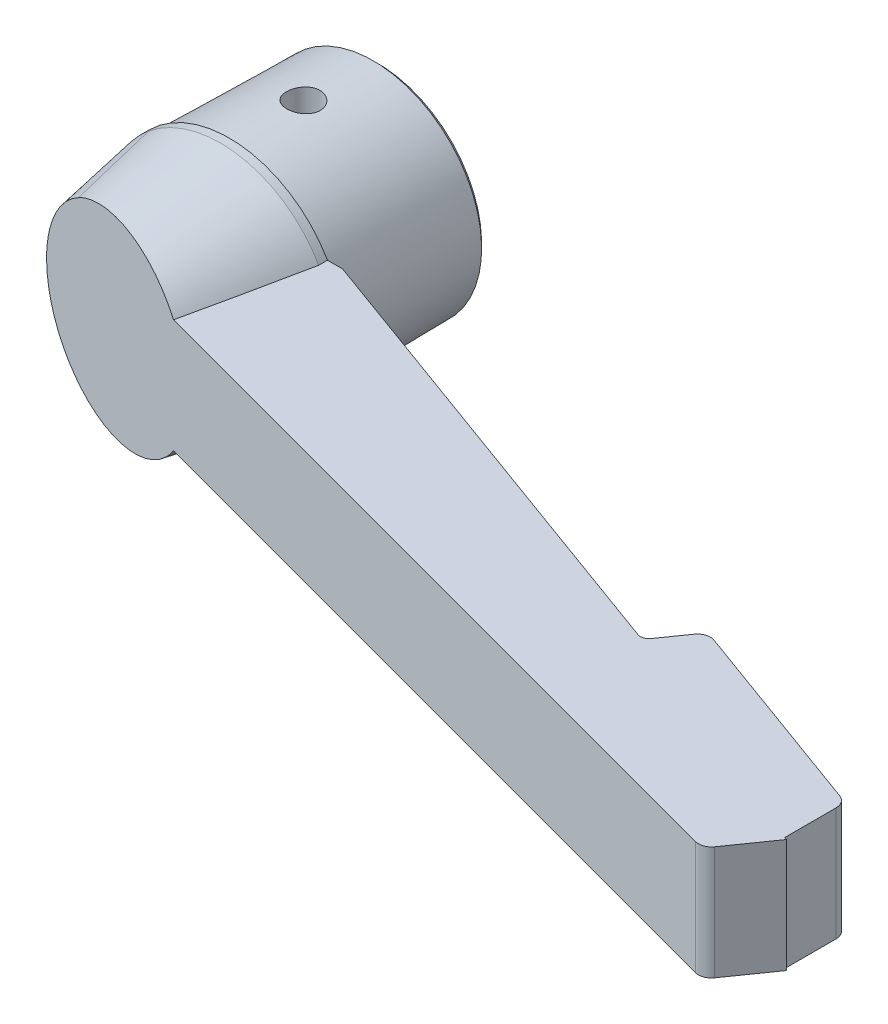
ISO-10303-21;
HEADER;
FILE_DESCRIPTION(('STEP AP214'),'2;1');
FILE_NAME('part.step','',(''),(''),'','','');
FILE_SCHEMA(('AUTOMOTIVE_DESIGN { 1 0 10303 214 1 1 1 1 }'));
ENDSEC;
DATA;
#1=APPLICATION_CONTEXT('core data for automotive mechanical design processes');
#2=APPLICATION_PROTOCOL_DEFINITION('international standard','automotive_design',2000,#1);
#3=PRODUCT_CONTEXT('',#1,'mechanical');
#4=PRODUCT('Part','Part','',(#3));
#5=PRODUCT_RELATED_PRODUCT_CATEGORY('part','',(#4));
#6=PRODUCT_DEFINITION_FORMATION('','',#4);
#7=PRODUCT_DEFINITION_CONTEXT('part definition',#1,'design');
#8=PRODUCT_DEFINITION('design','',#6,#7);
#9=PRODUCT_DEFINITION_SHAPE('','',#8);
#10=(LENGTH_UNIT() NAMED_UNIT(*) SI_UNIT(.MILLI.,.METRE.));
#11=(NAMED_UNIT(*) PLANE_ANGLE_UNIT() SI_UNIT($,.RADIAN.));
#12=(NAMED_UNIT(*) SI_UNIT($,.STERADIAN.) SOLID_ANGLE_UNIT());
#13=UNCERTAINTY_MEASURE_WITH_UNIT(LENGTH_MEASURE(1.E-05),#10,'distance_accuracy_value','');
#14=(GEOMETRIC_REPRESENTATION_CONTEXT(3) GLOBAL_UNCERTAINTY_ASSIGNED_CONTEXT((#13)) GLOBAL_UNIT_ASSIGNED_CONTEXT((#10,
#11,#12)) REPRESENTATION_CONTEXT('',''));
#15=CARTESIAN_POINT('',(0.,0.,0.));
#16=DIRECTION('',(0.,0.,1.));
#17=DIRECTION('',(1.,0.,0.));
#18=AXIS2_PLACEMENT_3D('',#15,#16,#17);
#19=CARTESIAN_POINT('',(0.,0.,32.2896880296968));
#20=DIRECTION('',(0.,0.,-1.));
#21=DIRECTION('',(0.,1.,0.));
#22=AXIS2_PLACEMENT_3D('',#19,#20,#21);
#23=CONICAL_SURFACE('',#22,10.4803424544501,0.174532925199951);
#24=CARTESIAN_POINT('',(14.597999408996,-6.5,1.10114409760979));
#25=CARTESIAN_POINT('',(14.4321255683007,-6.5,1.96051042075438));
#26=CARTESIAN_POINT('',(14.2658046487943,-6.5,2.81979044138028));
#27=CARTESIAN_POINT('',(13.9321611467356,-6.5,4.53815645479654));
#28=CARTESIAN_POINT('',(13.7648385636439,-6.5,5.3972424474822));
#29=CARTESIAN_POINT('',(13.2612097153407,-6.5,7.97416365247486));
#30=CARTESIAN_POINT('',(12.9232399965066,-6.5,9.69167430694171));
#31=CARTESIAN_POINT('',(12.2408256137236,-6.5,13.1301467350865));
#32=CARTESIAN_POINT('',(11.8963661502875,-6.5,14.8511055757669));
#33=CARTESIAN_POINT('',(11.2002243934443,-6.5,18.2915870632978));
#34=CARTESIAN_POINT('',(10.8485420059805,-6.5,20.0111096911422));
#35=CARTESIAN_POINT('',(10.1356822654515,-6.5,23.4479534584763));
#36=CARTESIAN_POINT('',(9.77450619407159,-6.5,25.1652748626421));
#37=CARTESIAN_POINT('',(9.22284580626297,-6.5,27.7391060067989));
#38=CARTESIAN_POINT('',(9.0373128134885,-6.5,28.5966769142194));
#39=CARTESIAN_POINT('',(8.662272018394,-6.5,30.3109496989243));
#40=CARTESIAN_POINT('',(8.47276422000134,-6.5,31.1676515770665));
#41=CARTESIAN_POINT('',(8.08929884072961,-6.5,32.8783309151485));
#42=CARTESIAN_POINT('',(7.89535051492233,-6.5,33.732310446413));
#43=CARTESIAN_POINT('',(7.50152045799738,-6.5,35.4388994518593));
#44=CARTESIAN_POINT('',(7.30163875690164,-6.5,36.2915089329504));
#45=CARTESIAN_POINT('',(6.89432715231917,-6.5,37.9951014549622));
#46=CARTESIAN_POINT('',(6.68689579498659,-6.5,38.8460841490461));
#47=CARTESIAN_POINT('',(6.26227756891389,-6.5,40.5456209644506));
#48=CARTESIAN_POINT('',(6.04509079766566,-6.5,41.3941751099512));
#49=CARTESIAN_POINT('',(5.70907006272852,-6.5,42.6654675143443));
#50=CARTESIAN_POINT('',(5.59520353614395,-6.5,43.0895188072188));
#51=CARTESIAN_POINT('',(5.3634876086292,-6.5,43.9365209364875));
#52=CARTESIAN_POINT('',(5.24563832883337,-6.5,44.35947180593));
#53=CARTESIAN_POINT('',(5.00520679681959,-6.5,45.2037636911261));
#54=CARTESIAN_POINT('',(4.88262733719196,-6.5,45.6251055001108));
#55=CARTESIAN_POINT('',(4.63155031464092,-6.5,46.4660760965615));
#56=CARTESIAN_POINT('',(4.50305215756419,-6.5,46.8857047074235));
#57=CARTESIAN_POINT('',(4.23827851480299,-6.5,47.7236193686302));
#58=CARTESIAN_POINT('',(4.10198506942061,-6.5,48.1418997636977));
#59=CARTESIAN_POINT('',(3.81967795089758,-6.5,48.9750798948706));
#60=CARTESIAN_POINT('',(3.67366693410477,-6.5,49.3899805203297));
#61=CARTESIAN_POINT('',(3.44448029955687,-6.5,50.0090113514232));
#62=CARTESIAN_POINT('',(3.36631121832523,-6.5,50.2149942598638));
#63=CARTESIAN_POINT('',(3.20593602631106,-6.5,50.625365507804));
#64=CARTESIAN_POINT('',(3.12373029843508,-6.5,50.8297539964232));
#65=CARTESIAN_POINT('',(2.95432227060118,-6.5,51.236683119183));
#66=CARTESIAN_POINT('',(2.86711549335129,-6.5,51.4392219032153));
#67=CARTESIAN_POINT('',(2.73167045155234,-6.5,51.740988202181));
#68=CARTESIAN_POINT('',(2.68574176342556,-6.5,51.8412528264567));
#69=CARTESIAN_POINT('',(2.59212405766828,-6.5,52.0409654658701));
#70=CARTESIAN_POINT('',(2.54443490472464,-6.5,52.1404134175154));
#71=CARTESIAN_POINT('',(2.49575939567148,-6.5,52.2393829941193));
#72=B_SPLINE_CURVE_WITH_KNOTS('',3,(#24,#25,#26,#27,#28,#29,#30,#31,#32,#33,#34,#35,#36,#37,#38,
#39,#40,#41,#42,#43,#44,#45,#46,#47,#48,#49,#50,#51,#52,#53,#54,#55,#56,#57,#58,#59,#60,#61,#62,
#63,#64,#65,#66,#67,#68,#69,#70,#71),.UNSPECIFIED.,.F.,.F.,(4,2,2,2,2,2,2,2,2,2,2,2,2,2,2,2,2,2,
2,2,2,2,2,4),(0.,2.62568474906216,5.2513709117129,10.5027059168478,15.7679729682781,
21.0333086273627,26.2979370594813,28.9301632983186,31.5623869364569,34.1895501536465,
36.8167000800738,39.4443586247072,42.0719909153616,43.389194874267,44.7063588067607,
46.0227566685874,47.3392869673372,48.6589832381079,49.9783202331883,50.6392362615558,
51.30008971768,51.9615443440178,52.2923794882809,52.6232401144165),.UNSPECIFIED.);
#73=CARTESIAN_POINT('',(8.34911340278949,-6.5,31.7187949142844));
#74=VERTEX_POINT('',#73);
#75=CARTESIAN_POINT('',(11.2583302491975,-6.5,18.));
#76=VERTEX_POINT('',#75);
#77=EDGE_CURVE('E28',#74,#76,#72,.F.);
#78=ORIENTED_EDGE('',*,*,#77,.F.);
#79=CARTESIAN_POINT('',(-0.519555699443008,0.,29.343141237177));
#80=DIRECTION('',(-0.258748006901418,0.,0.965944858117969));
#81=DIRECTION('',(-0.965944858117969,0.,-0.258748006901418));
#82=AXIS2_PLACEMENT_3D('',#79,#80,#81);
#83=ELLIPSE('',#82,11.3877081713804,10.9876212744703);
#84=CARTESIAN_POINT('',(-6.20318997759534,-9.40724136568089,27.8206640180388));
#85=VERTEX_POINT('',#84);
#86=EDGE_CURVE('E165',#74,#85,#83,.F.);
#87=ORIENTED_EDGE('',*,*,#86,.T.);
#88=CARTESIAN_POINT('',(-5.6209360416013,-8.84544610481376,32.2898880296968));
#89=CARTESIAN_POINT('',(-5.77682805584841,-8.99510535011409,31.0993107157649));
#90=CARTESIAN_POINT('',(-5.93205718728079,-9.1447753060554,29.9086481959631));
#91=CARTESIAN_POINT('',(-6.24141971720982,-9.44413275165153,27.5271836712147));
#92=CARTESIAN_POINT('',(-6.39555311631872,-9.59382024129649,26.3363816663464));
#93=CARTESIAN_POINT('',(-6.7029543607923,-9.89320900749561,23.954667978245));
#94=CARTESIAN_POINT('',(-6.85622220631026,-10.0429102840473,22.7637562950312));
#95=CARTESIAN_POINT('',(-7.1620410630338,-10.3423243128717,20.3818416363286));
#96=CARTESIAN_POINT('',(-7.31459207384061,-10.4920370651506,19.1908386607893));
#97=CARTESIAN_POINT('',(-7.46685892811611,-10.6417543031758,17.9998));
#98=B_SPLINE_CURVE_WITH_KNOTS('',3,(#88,#89,#90,#91,#92,#93,#94,#95,#96,#97),.UNSPECIFIED.,.F.,
.F.,(4,2,2,2,4),(0.,3.63009188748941,7.26018174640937,10.8902709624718,14.5203621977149),.UNSPECIFIED.);
#99=CARTESIAN_POINT('',(-7.46683336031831,-10.6417291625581,18.));
#100=VERTEX_POINT('',#99);
#101=EDGE_CURVE('E183',#85,#100,#98,.T.);
#102=ORIENTED_EDGE('',*,*,#101,.T.);
#103=CARTESIAN_POINT('',(0.,0.,18.));
#104=DIRECTION('',(0.,0.,1.));
#105=DIRECTION('',(0.,-1.,0.));
#106=AXIS2_PLACEMENT_3D('',#103,#104,#105);
#107=CIRCLE('',#106,13.);
#108=EDGE_CURVE('E275',#100,#76,#107,.T.);
#109=ORIENTED_EDGE('',*,*,#108,.T.);
#110=EDGE_LOOP('',(#78,#87,#102,#109));
#111=FACE_BOUND('',#110,.T.);
#112=ADVANCED_FACE('F14',(#111),#23,.T.);
#113=CARTESIAN_POINT('',(-8.20740158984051,10.0816405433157,17.9998));
#114=CARTESIAN_POINT('',(-8.00100574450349,9.97848397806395,19.1922707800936));
#115=CARTESIAN_POINT('',(-7.79312672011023,9.87534915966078,20.3844901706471));
#116=CARTESIAN_POINT('',(-7.37330025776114,9.66914332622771,22.7681913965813));
#117=CARTESIAN_POINT('',(-7.16135290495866,9.56607230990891,23.9596732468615));
#118=CARTESIAN_POINT('',(-6.73227761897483,9.36000931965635,26.3417232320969));
#119=CARTESIAN_POINT('',(-6.5151496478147,9.25701734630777,27.5322913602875));
#120=CARTESIAN_POINT('',(-6.18422977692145,9.10261148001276,29.3171945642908));
#121=CARTESIAN_POINT('',(-6.07305064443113,9.0511560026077,29.91201034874));
#122=CARTESIAN_POINT('',(-5.84862194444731,8.94827843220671,31.1012560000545));
#123=CARTESIAN_POINT('',(-5.73537236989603,8.89685633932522,31.6956858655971));
#124=CARTESIAN_POINT('',(-5.6209237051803,8.84545394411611,32.2898880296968));
#125=B_SPLINE_CURVE_WITH_KNOTS('',3,(#113,#114,#115,#116,#117,#118,#119,#120,#121,#122,#123,
#124),.UNSPECIFIED.,.F.,.F.,(4,2,2,2,2,4),(0.,3.64377168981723,7.28746719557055,
10.9311894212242,12.7530886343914,14.5749940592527),.UNSPECIFIED.);
#126=CARTESIAN_POINT('',(-8.20736698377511,10.0816232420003,18.));
#127=VERTEX_POINT('',#126);
#128=CARTESIAN_POINT('',(-6.47436274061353,9.23835497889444,27.7480248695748));
#129=VERTEX_POINT('',#128);
#130=EDGE_CURVE('E164',#127,#129,#125,.T.);
#131=ORIENTED_EDGE('',*,*,#130,.T.);
#132=CARTESIAN_POINT('',(-0.519555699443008,0.,29.343141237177));
#133=DIRECTION('',(-0.258748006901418,0.,0.965944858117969));
#134=DIRECTION('',(-0.965944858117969,0.,-0.258748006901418));
#135=AXIS2_PLACEMENT_3D('',#132,#133,#134);
#136=ELLIPSE('',#135,11.3877081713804,10.9876212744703);
#137=CARTESIAN_POINT('',(8.34911340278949,6.5,31.7187949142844));
#138=VERTEX_POINT('',#137);
#139=EDGE_CURVE('E35',#129,#138,#136,.F.);
#140=ORIENTED_EDGE('',*,*,#139,.T.);
#141=CARTESIAN_POINT('',(14.597999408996,6.5,1.10114409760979));
#142=CARTESIAN_POINT('',(14.4321255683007,6.5,1.96051042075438));
#143=CARTESIAN_POINT('',(14.2658046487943,6.5,2.81979044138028));
#144=CARTESIAN_POINT('',(13.9321611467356,6.5,4.53815645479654));
#145=CARTESIAN_POINT('',(13.7648385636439,6.5,5.3972424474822));
#146=CARTESIAN_POINT('',(13.2612097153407,6.5,7.97416365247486));
#147=CARTESIAN_POINT('',(12.9232399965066,6.5,9.69167430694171));
#148=CARTESIAN_POINT('',(12.2408256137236,6.5,13.1301467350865));
#149=CARTESIAN_POINT('',(11.8963661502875,6.5,14.8511055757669));
#150=CARTESIAN_POINT('',(11.2002243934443,6.5,18.2915870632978));
#151=CARTESIAN_POINT('',(10.8485420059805,6.5,20.0111096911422));
#152=CARTESIAN_POINT('',(10.1356822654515,6.5,23.4479534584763));
#153=CARTESIAN_POINT('',(9.77450619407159,6.5,25.1652748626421));
#154=CARTESIAN_POINT('',(9.22284580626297,6.5,27.7391060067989));
#155=CARTESIAN_POINT('',(9.0373128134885,6.5,28.5966769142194));
#156=CARTESIAN_POINT('',(8.662272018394,6.5,30.3109496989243));
#157=CARTESIAN_POINT('',(8.47276422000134,6.5,31.1676515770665));
#158=CARTESIAN_POINT('',(8.08929884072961,6.5,32.8783309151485));
#159=CARTESIAN_POINT('',(7.89535051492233,6.5,33.732310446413));
#160=CARTESIAN_POINT('',(7.50152045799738,6.5,35.4388994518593));
#161=CARTESIAN_POINT('',(7.30163875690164,6.5,36.2915089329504));
#162=CARTESIAN_POINT('',(6.89432715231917,6.5,37.9951014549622));
#163=CARTESIAN_POINT('',(6.68689579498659,6.5,38.8460841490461));
#164=CARTESIAN_POINT('',(6.26227756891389,6.5,40.5456209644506));
#165=CARTESIAN_POINT('',(6.04509079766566,6.5,41.3941751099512));
#166=CARTESIAN_POINT('',(5.70907006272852,6.5,42.6654675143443));
#167=CARTESIAN_POINT('',(5.59520353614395,6.5,43.0895188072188));
#168=CARTESIAN_POINT('',(5.3634876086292,6.5,43.9365209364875));
#169=CARTESIAN_POINT('',(5.24563832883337,6.5,44.35947180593));
#170=CARTESIAN_POINT('',(5.00520679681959,6.5,45.2037636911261));
#171=CARTESIAN_POINT('',(4.88262733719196,6.5,45.6251055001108));
#172=CARTESIAN_POINT('',(4.63155031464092,6.5,46.4660760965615));
#173=CARTESIAN_POINT('',(4.50305215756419,6.5,46.8857047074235));
#174=CARTESIAN_POINT('',(4.23827851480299,6.5,47.7236193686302));
#175=CARTESIAN_POINT('',(4.10198506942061,6.5,48.1418997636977));
#176=CARTESIAN_POINT('',(3.81967795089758,6.5,48.9750798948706));
#177=CARTESIAN_POINT('',(3.67366693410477,6.5,49.3899805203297));
#178=CARTESIAN_POINT('',(3.44448029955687,6.5,50.0090113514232));
#179=CARTESIAN_POINT('',(3.36631121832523,6.5,50.2149942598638));
#180=CARTESIAN_POINT('',(3.20593602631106,6.5,50.625365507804));
#181=CARTESIAN_POINT('',(3.12373029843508,6.5,50.8297539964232));
#182=CARTESIAN_POINT('',(2.95432227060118,6.5,51.236683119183));
#183=CARTESIAN_POINT('',(2.86711549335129,6.5,51.4392219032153));
#184=CARTESIAN_POINT('',(2.73167045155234,6.5,51.740988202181));
#185=CARTESIAN_POINT('',(2.68574176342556,6.5,51.8412528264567));
#186=CARTESIAN_POINT('',(2.59212405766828,6.5,52.0409654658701));
#187=CARTESIAN_POINT('',(2.54443490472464,6.5,52.1404134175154));
#188=CARTESIAN_POINT('',(2.49575939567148,6.5,52.2393829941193));
#189=B_SPLINE_CURVE_WITH_KNOTS('',3,(#141,#142,#143,#144,#145,#146,#147,#148,#149,#150,#151,
#152,#153,#154,#155,#156,#157,#158,#159,#160,#161,#162,#163,#164,#165,#166,#167,#168,#169,#170,
#171,#172,#173,#174,#175,#176,#177,#178,#179,#180,#181,#182,#183,#184,#185,#186,#187,#188),
.UNSPECIFIED.,.F.,.F.,(4,2,2,2,2,2,2,2,2,2,2,2,2,2,2,2,2,2,2,2,2,2,2,4),(0.,2.62568474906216,
5.2513709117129,10.5027059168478,15.7679729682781,21.0333086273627,26.2979370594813,
28.9301632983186,31.5623869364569,34.1895501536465,36.8167000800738,39.4443586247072,
42.0719909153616,43.389194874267,44.7063588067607,46.0227566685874,47.3392869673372,
48.6589832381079,49.9783202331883,50.6392362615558,51.30008971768,51.9615443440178,
52.2923794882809,52.6232401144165),.UNSPECIFIED.);
#190=CARTESIAN_POINT('',(11.2583302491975,6.5,18.));
#191=VERTEX_POINT('',#190);
#192=EDGE_CURVE('E248',#138,#191,#189,.F.);
#193=ORIENTED_EDGE('',*,*,#192,.T.);
#194=EDGE_CURVE('E292',#191,#127,#107,.T.);
#195=ORIENTED_EDGE('',*,*,#194,.T.);
#196=EDGE_LOOP('',(#131,#140,#193,#195));
#197=FACE_BOUND('',#196,.T.);
#198=ADVANCED_FACE('F232',(#197),#23,.T.);
#199=CARTESIAN_POINT('',(-10.4803424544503,0.,32.2896880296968));
#200=CARTESIAN_POINT('',(-10.7603044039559,0.,30.701944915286));
#201=CARTESIAN_POINT('',(-11.3202283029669,0.,27.5264586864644));
#202=CARTESIAN_POINT('',(-12.1601141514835,0.,22.7632293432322));
#203=CARTESIAN_POINT('',(-12.7200380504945,0.,19.5877431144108));
#204=CARTESIAN_POINT('',(-13.0000000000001,0.,18.));
#205=CARTESIAN_POINT('',(-10.4803424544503,-0.00350459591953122,32.2896880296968));
#206=CARTESIAN_POINT('',(-10.7603044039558,-0.00357761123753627,30.7019449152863));
#207=CARTESIAN_POINT('',(-11.3202283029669,-0.00372388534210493,27.5264586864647));
#208=CARTESIAN_POINT('',(-12.1601141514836,-0.00394402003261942,22.7632293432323));
#209=CARTESIAN_POINT('',(-12.7200380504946,-0.00409125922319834,19.5877431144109));
#210=CARTESIAN_POINT('',(-13.0000000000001,-0.0041650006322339,18.0000000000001));
#211=CARTESIAN_POINT('',(-10.4803336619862,-0.0210343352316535,32.2896880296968));
#212=CARTESIAN_POINT('',(-10.7602982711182,-0.0214724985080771,30.7019290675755));
#213=CARTESIAN_POINT('',(-11.3202246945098,-0.0223502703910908,27.5264269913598));
#214=CARTESIAN_POINT('',(-12.1601101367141,-0.0236712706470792,22.7631976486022));
#215=CARTESIAN_POINT('',(-12.7200309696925,-0.0245548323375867,19.5877272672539));
#216=CARTESIAN_POINT('',(-12.9999899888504,-0.0249973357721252,18.0000000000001));
#217=CARTESIAN_POINT('',(-10.4799101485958,-0.161721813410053,32.2896880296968));
#218=CARTESIAN_POINT('',(-10.7598868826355,-0.165086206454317,30.7018235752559));
#219=CARTESIAN_POINT('',(-11.3198189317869,-0.171825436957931,27.5262160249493));
#220=CARTESIAN_POINT('',(-12.1596848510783,-0.18196599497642,22.7629867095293));
#221=CARTESIAN_POINT('',(-12.7195740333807,-0.188747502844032,19.5876218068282));
#222=CARTESIAN_POINT('',(-12.999507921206,-0.192143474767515,18.0000000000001));
#223=CARTESIAN_POINT('',(-10.4691469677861,-0.637429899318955,32.2896880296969));
#224=CARTESIAN_POINT('',(-10.749020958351,-0.65064821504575,30.7014797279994));
#225=CARTESIAN_POINT('',(-11.3086864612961,-0.677117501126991,27.5255285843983));
#226=CARTESIAN_POINT('',(-12.1480603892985,-0.716925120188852,22.7622996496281));
#227=CARTESIAN_POINT('',(-12.7075602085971,-0.743532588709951,19.5872784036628));
#228=CARTESIAN_POINT('',(-12.9872689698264,-0.756852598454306,18.));
#229=CARTESIAN_POINT('',(-10.1483957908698,-4.24692500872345,32.2896880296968));
#230=CARTESIAN_POINT('',(-10.4240414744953,-4.33264404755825,30.6992007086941));
#231=CARTESIAN_POINT('',(-10.9748570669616,-4.5039312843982,27.5209797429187));
#232=CARTESIAN_POINT('',(-11.8003714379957,-4.76063303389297,22.7577645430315));
#233=CARTESIAN_POINT('',(-12.3502445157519,-4.93161571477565,19.5850154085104));
#234=CARTESIAN_POINT('',(-12.6249462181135,-5.01703260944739,18.));
#235=CARTESIAN_POINT('',(-8.2468915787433,-7.17679252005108,32.2896880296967));
#236=CARTESIAN_POINT('',(-8.49464452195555,-7.3276272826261,30.6996007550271));
#237=CARTESIAN_POINT('',(-8.9898050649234,-7.62904886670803,27.521777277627));
#238=CARTESIAN_POINT('',(-9.732060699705,-8.08077324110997,22.7585582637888));
#239=CARTESIAN_POINT('',(-10.2265759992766,-8.38165222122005,19.585411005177));
#240=CARTESIAN_POINT('',(-10.4736628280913,-8.53196915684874,18.));
#241=CARTESIAN_POINT('',(-5.62096223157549,-8.84547124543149,32.2896880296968));
#242=CARTESIAN_POINT('',(-5.82605902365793,-9.04505545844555,30.701944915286));
#243=CARTESIAN_POINT('',(-6.23625260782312,-9.44422388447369,27.5264586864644));
#244=CARTESIAN_POINT('',(-6.8515429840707,-10.0429765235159,22.7632293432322));
#245=CARTESIAN_POINT('',(-7.26173656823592,-10.442144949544,19.5877431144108));
#246=CARTESIAN_POINT('',(-7.46683336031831,-10.6417291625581,18.));
#247=(BOUNDED_SURFACE() B_SPLINE_SURFACE(3,3,((#199,#200,#201,#202,#203,#204),(#205,#206,#207,
#208,#209,#210),(#211,#212,#213,#214,#215,#216),(#217,#218,#219,#220,#221,#222),(#223,#224,#225,
#226,#227,#228),(#229,#230,#231,#232,#233,#234),(#235,#236,#237,#238,#239,#240),(#241,#242,#243,
#244,#245,#246)),.UNSPECIFIED.,.F.,.F.,.F.) B_SPLINE_SURFACE_WITH_KNOTS((4,1,1,1,1,4),(4,1,1,4),
(0.,0.00104166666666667,0.00520833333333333,0.0416666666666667,0.140625,1.),(0.,
0.333333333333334,0.666666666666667,1.),
.UNSPECIFIED.) GEOMETRIC_REPRESENTATION_ITEM() RATIONAL_B_SPLINE_SURFACE(((1.,1.,1.,1.,1.,1.),
(0.999914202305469,0.999915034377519,0.999916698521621,0.999919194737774,0.999920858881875,
0.999921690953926),(0.999485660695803,0.9994906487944,0.999500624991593,0.999515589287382,
0.999525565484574,0.999530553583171),(0.996075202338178,0.996113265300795,0.996189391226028,
0.996303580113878,0.996379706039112,0.996417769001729),(0.985117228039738,0.985261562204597,
0.985550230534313,0.985983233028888,0.986271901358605,0.986416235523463),(0.918116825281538,
0.918910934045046,0.920499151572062,0.922881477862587,0.924469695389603,0.925263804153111),
(0.929216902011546,0.929903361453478,0.931276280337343,0.93333565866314,0.934708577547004,
0.935395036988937),(1.,1.,1.,1.,1.,1.))) REPRESENTATION_ITEM('') SURFACE());
#248=CARTESIAN_POINT('',(-11.5194538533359,0.,26.3965944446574));
#249=CARTESIAN_POINT('',(-11.5194923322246,-0.300899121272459,26.3965841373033));
#250=CARTESIAN_POINT('',(-11.5070725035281,-0.601789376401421,26.3999110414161));
#251=CARTESIAN_POINT('',(-11.4575986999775,-1.20135712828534,26.4131636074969));
#252=CARTESIAN_POINT('',(-11.4205476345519,-1.50003488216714,26.423088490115));
#253=CARTESIAN_POINT('',(-11.3221966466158,-2.09243463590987,26.4494338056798));
#254=CARTESIAN_POINT('',(-11.2609475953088,-2.38616569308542,26.4658406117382));
#255=CARTESIAN_POINT('',(-11.1147385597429,-2.96722980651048,26.5050056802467));
#256=CARTESIAN_POINT('',(-11.0297786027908,-3.2545628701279,26.5277639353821));
#257=CARTESIAN_POINT('',(-10.8368636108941,-3.82082831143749,26.5794401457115));
#258=CARTESIAN_POINT('',(-10.7289086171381,-4.0997607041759,26.6083580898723));
#259=CARTESIAN_POINT('',(-10.4908947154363,-4.64733596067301,26.6721149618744));
#260=CARTESIAN_POINT('',(-10.3608349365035,-4.91597841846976,26.7069541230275));
#261=CARTESIAN_POINT('',(-10.0795776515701,-5.44134679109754,26.7822946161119));
#262=CARTESIAN_POINT('',(-9.92836684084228,-5.69806506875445,26.8227995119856));
#263=CARTESIAN_POINT('',(-9.60606760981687,-6.19774241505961,26.9091339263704));
#264=CARTESIAN_POINT('',(-9.43497973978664,-6.44070186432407,26.9549632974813));
#265=CARTESIAN_POINT('',(-9.07125791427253,-6.91523731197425,27.0523935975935));
#266=CARTESIAN_POINT('',(-8.87831540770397,-7.14655980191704,27.1040771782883));
#267=CARTESIAN_POINT('',(-8.47471747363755,-7.5919983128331,27.2121891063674));
#268=CARTESIAN_POINT('',(-8.26406207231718,-7.80611435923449,27.2686174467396));
#269=CARTESIAN_POINT('',(-7.82695545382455,-8.21553337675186,27.3857053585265));
#270=CARTESIAN_POINT('',(-7.60052938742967,-8.41086517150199,27.4463581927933));
#271=CARTESIAN_POINT('',(-7.1332882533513,-8.78190217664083,27.5715182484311));
#272=CARTESIAN_POINT('',(-6.89248131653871,-8.95761831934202,27.6360232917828));
#273=CARTESIAN_POINT('',(-6.57186509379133,-9.17222886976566,27.7219068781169));
#274=CARTESIAN_POINT('',(-6.49781610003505,-9.22051024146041,27.7417424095));
#275=CARTESIAN_POINT('',(-6.34870996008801,-9.31518978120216,27.7816835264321));
#276=CARTESIAN_POINT('',(-6.27365395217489,-9.36158987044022,27.8017888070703));
#277=CARTESIAN_POINT('',(-6.19807151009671,-9.40706901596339,27.8220351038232));
#278=B_SPLINE_CURVE_WITH_KNOTS('',3,(#248,#249,#250,#251,#252,#253,#254,#255,#256,#257,#258,
#259,#260,#261,#262,#263,#264,#265,#266,#267,#268,#269,#270,#271,#272,#273,#274,#275,#276,#277),
.UNSPECIFIED.,.F.,.F.,(4,2,2,2,2,2,2,2,2,2,2,2,2,2,4),(0.,0.902409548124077,1.80471252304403,
2.70512860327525,3.60554364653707,4.50595707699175,5.40640599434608,6.30742389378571,
7.2084168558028,8.12425463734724,9.04009106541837,9.95449897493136,10.8683946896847,
11.1401683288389,11.4116570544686),.UNSPECIFIED.);
#279=CARTESIAN_POINT('',(-11.5194538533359,0.,26.3965944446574));
#280=VERTEX_POINT('',#279);
#281=CARTESIAN_POINT('',(-6.19807151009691,-9.40706901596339,27.8220351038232));
#282=VERTEX_POINT('',#281);
#283=EDGE_CURVE('E160',#280,#282,#278,.T.);
#284=DIRECTION('',(0.173648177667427,0.,0.98480775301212));
#285=VECTOR('',#284,1.);
#286=CARTESIAN_POINT('',(-11.7401712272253,0.,25.1448440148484));
#287=LINE('',#286,#285);
#288=CARTESIAN_POINT('',(-13.0000000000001,0.,18.));
#289=VERTEX_POINT('',#288);
#290=EDGE_CURVE('E159',#289,#280,#287,.T.);
#291=EDGE_CURVE('E289',#289,#100,#107,.T.);
#292=DIRECTION('',(-0.127126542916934,-0.123709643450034,-0.984141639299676));
#293=VECTOR('',#292,1.);
#294=CARTESIAN_POINT('',(-6.54389779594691,-9.74360020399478,25.1448440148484));
#295=LINE('',#294,#293);
#296=EDGE_CURVE('E167',#282,#100,#295,.T.);
#297=ORIENTED_EDGE('',*,*,#283,.F.);
#298=ORIENTED_EDGE('',*,*,#290,.F.);
#299=ORIENTED_EDGE('',*,*,#291,.T.);
#300=ORIENTED_EDGE('',*,*,#296,.F.);
#301=EDGE_LOOP('',(#297,#298,#299,#300));
#302=FACE_BOUND('',#301,.T.);
#303=ADVANCED_FACE('F226',(#302),#247,.F.);
#304=CARTESIAN_POINT('',(-14.4704770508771,-9.74360020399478,25.1448440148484));
#305=DIRECTION('',(0.,0.992191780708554,-0.12472157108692));
#306=DIRECTION('',(0.,0.12472157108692,0.992191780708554));
#307=AXIS2_PLACEMENT_3D('',#304,#305,#306);
#308=PLANE('',#307);
#309=ORIENTED_EDGE('',*,*,#101,.F.);
#310=DIRECTION('',(0.965434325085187,0.0325082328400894,0.258611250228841));
#311=VECTOR('',#310,1.);
#312=CARTESIAN_POINT('',(-14.5874602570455,-9.68955762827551,25.574766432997));
#313=LINE('',#312,#311);
#314=EDGE_CURVE('E170',#85,#282,#313,.T.);
#315=ORIENTED_EDGE('',*,*,#314,.T.);
#316=ORIENTED_EDGE('',*,*,#296,.T.);
#317=EDGE_LOOP('',(#309,#315,#316));
#318=FACE_BOUND('',#317,.T.);
#319=ADVANCED_FACE('F203',(#318),#308,.T.);
#320=CARTESIAN_POINT('',(-5.62096223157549,8.84547124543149,32.2896880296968));
#321=CARTESIAN_POINT('',(-5.9083405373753,8.98282146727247,30.701944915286));
#322=CARTESIAN_POINT('',(-6.4830971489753,9.25752191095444,27.5264586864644));
#323=CARTESIAN_POINT('',(-7.3452320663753,9.66957257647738,22.7632293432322));
#324=CARTESIAN_POINT('',(-7.91998867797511,9.94427302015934,19.5877431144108));
#325=CARTESIAN_POINT('',(-8.20736698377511,10.0816232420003,18.));
#326=CARTESIAN_POINT('',(-8.2468915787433,7.17679252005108,32.2896880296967));
#327=CARTESIAN_POINT('',(-8.53528476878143,7.26246472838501,30.6961488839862));
#328=CARTESIAN_POINT('',(-9.11100723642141,7.43343289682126,27.5149087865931));
#329=CARTESIAN_POINT('',(-9.9729958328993,7.68923250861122,22.7517421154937));
#330=CARTESIAN_POINT('',(-10.5466049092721,7.85933597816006,19.5820202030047));
#331=CARTESIAN_POINT('',(-10.8328918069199,7.94420496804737,18.));
#332=CARTESIAN_POINT('',(-10.1483957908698,4.24692500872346,32.2896880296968));
#333=CARTESIAN_POINT('',(-10.4307545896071,4.2895152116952,30.6951610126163));
#334=CARTESIAN_POINT('',(-10.994259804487,4.37450825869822,27.5129486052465));
#335=CARTESIAN_POINT('',(-11.8377132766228,4.501712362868,22.7498049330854));
#336=CARTESIAN_POINT('',(-12.3988304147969,4.58632759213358,19.5810591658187));
#337=CARTESIAN_POINT('',(-12.678801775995,4.62854448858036,18.0000000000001));
#338=CARTESIAN_POINT('',(-10.4691469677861,0.637429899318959,32.2896880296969));
#339=CARTESIAN_POINT('',(-10.7493325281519,0.644705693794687,30.7007937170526));
#340=CARTESIAN_POINT('',(-11.3095006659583,0.659293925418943,27.5241579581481));
#341=CARTESIAN_POINT('',(-12.1494493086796,0.681293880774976,22.7609311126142));
#342=CARTESIAN_POINT('',(-12.7092132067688,0.696038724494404,19.5865948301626));
#343=CARTESIAN_POINT('',(-12.9889942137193,0.703429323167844,18.));
#344=CARTESIAN_POINT('',(-10.4799101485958,0.161721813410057,32.2896880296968));
#345=CARTESIAN_POINT('',(-10.7599257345,0.163595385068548,30.7016445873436));
#346=CARTESIAN_POINT('',(-11.3199039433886,0.167354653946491,27.5258581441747));
#347=CARTESIAN_POINT('',(-12.1597918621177,0.173030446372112,22.7626289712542));
#348=CARTESIAN_POINT('',(-12.7196642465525,0.17683888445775,19.5874429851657));
#349=CARTESIAN_POINT('',(-12.9995739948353,0.178749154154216,18.0000000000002));
#350=CARTESIAN_POINT('',(-10.4803336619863,0.0210343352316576,32.2896880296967));
#351=CARTESIAN_POINT('',(-10.7603025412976,0.0212794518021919,30.7019056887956));
#352=CARTESIAN_POINT('',(-11.3202333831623,0.0217713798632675,27.526380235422));
#353=CARTESIAN_POINT('',(-12.1601192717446,0.0225143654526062,22.7631508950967));
#354=CARTESIAN_POINT('',(-12.7200362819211,0.0230130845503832,19.587703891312));
#355=CARTESIAN_POINT('',(-12.9999913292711,0.023263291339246,18.));
#356=CARTESIAN_POINT('',(-10.4803424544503,0.00350459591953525,32.2896880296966));
#357=CARTESIAN_POINT('',(-10.7603044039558,0.00354546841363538,30.7019449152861));
#358=CARTESIAN_POINT('',(-11.3202283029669,0.00362750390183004,27.5264586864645));
#359=CARTESIAN_POINT('',(-12.1601141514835,0.00375138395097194,22.7632293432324));
#360=CARTESIAN_POINT('',(-12.7200380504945,0.00383452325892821,19.5877431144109));
#361=CARTESIAN_POINT('',(-13.0000000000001,0.00387623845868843,18.));
#362=CARTESIAN_POINT('',(-10.4803424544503,0.,32.2896880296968));
#363=CARTESIAN_POINT('',(-10.7603044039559,0.,30.701944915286));
#364=CARTESIAN_POINT('',(-11.3202283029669,0.,27.5264586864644));
#365=CARTESIAN_POINT('',(-12.1601141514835,0.,22.7632293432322));
#366=CARTESIAN_POINT('',(-12.7200380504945,0.,19.5877431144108));
#367=CARTESIAN_POINT('',(-13.0000000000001,0.,18.));
#368=(BOUNDED_SURFACE() B_SPLINE_SURFACE(3,3,((#320,#321,#322,#323,#324,#325),(#326,#327,#328,
#329,#330,#331),(#332,#333,#334,#335,#336,#337),(#338,#339,#340,#341,#342,#343),(#344,#345,#346,
#347,#348,#349),(#350,#351,#352,#353,#354,#355),(#356,#357,#358,#359,#360,#361),(#362,#363,#364,
#365,#366,#367)),.UNSPECIFIED.,.F.,.F.,.F.) B_SPLINE_SURFACE_WITH_KNOTS((4,1,1,1,1,4),(4,1,1,4),
(0.,0.859375,0.958333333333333,0.994791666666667,0.998958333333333,1.),(0.,0.333333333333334,
0.666666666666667,1.),
.UNSPECIFIED.) GEOMETRIC_REPRESENTATION_ITEM() RATIONAL_B_SPLINE_SURFACE(((1.,1.,1.,1.,1.,1.),
(0.929216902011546,0.930916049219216,0.934314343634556,0.939411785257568,0.942810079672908,
0.944509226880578),(0.918116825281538,0.920082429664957,0.924013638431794,0.92991045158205,
0.933841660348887,0.935807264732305),(0.985117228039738,0.985474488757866,0.986189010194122,
0.987260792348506,0.987975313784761,0.988332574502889),(0.996075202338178,0.9961694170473,
0.996357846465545,0.996640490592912,0.996828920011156,0.996923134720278),(0.999485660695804,
0.999498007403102,0.999522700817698,0.999559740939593,0.999584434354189,0.999596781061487),
(0.999914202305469,0.999916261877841,0.999920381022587,0.999926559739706,0.999930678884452,
0.999932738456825),(1.,1.,1.,1.,1.,1.))) REPRESENTATION_ITEM('') SURFACE());
#369=CARTESIAN_POINT('',(-6.4413957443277,9.23759104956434,27.7568557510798));
#370=CARTESIAN_POINT('',(-6.6130159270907,9.12852978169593,27.71088378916));
#371=CARTESIAN_POINT('',(-6.78174871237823,9.0145927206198,27.6656852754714));
#372=CARTESIAN_POINT('',(-7.11292766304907,8.77726391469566,27.5769722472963));
#373=CARTESIAN_POINT('',(-7.2753729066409,8.65387079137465,27.5334579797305));
#374=CARTESIAN_POINT('',(-7.5934208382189,8.39795370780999,27.4482623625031));
#375=CARTESIAN_POINT('',(-7.74902325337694,8.26542938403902,27.4065810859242));
#376=CARTESIAN_POINT('',(-8.05287093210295,7.99159773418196,27.3251892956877));
#377=CARTESIAN_POINT('',(-8.20111542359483,7.85028948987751,27.2854789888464));
#378=CARTESIAN_POINT('',(-8.48971352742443,7.5592958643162,27.2081721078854));
#379=CARTESIAN_POINT('',(-8.6300675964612,7.40961096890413,27.1705754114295));
#380=CARTESIAN_POINT('',(-8.90238861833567,7.10229717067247,27.0976286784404));
#381=CARTESIAN_POINT('',(-9.03435572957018,6.94466841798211,27.0622785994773));
#382=CARTESIAN_POINT('',(-9.35350165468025,6.54084160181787,26.9767888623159));
#383=CARTESIAN_POINT('',(-9.53513757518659,6.28990746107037,26.9281339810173));
#384=CARTESIAN_POINT('',(-9.87699802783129,5.77266275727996,26.8365596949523));
#385=CARTESIAN_POINT('',(-10.0372093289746,5.50634283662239,26.7936438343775));
#386=CARTESIAN_POINT('',(-10.3345947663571,4.96057034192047,26.7139830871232));
#387=CARTESIAN_POINT('',(-10.4717896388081,4.68112988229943,26.6772326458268));
#388=CARTESIAN_POINT('',(-10.7220267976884,4.11107150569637,26.610201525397));
#389=CARTESIAN_POINT('',(-10.8350849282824,3.82046106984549,26.5799166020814));
#390=CARTESIAN_POINT('',(-10.9996319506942,3.33728811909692,26.5358393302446));
#391=CARTESIAN_POINT('',(-11.0585764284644,3.14740832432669,26.5200498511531));
#392=CARTESIAN_POINT('',(-11.1660788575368,2.76451452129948,26.4912531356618));
#393=CARTESIAN_POINT('',(-11.2146371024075,2.57150060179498,26.4782458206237));
#394=CARTESIAN_POINT('',(-11.3011771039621,2.18295542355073,26.4550643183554));
#395=CARTESIAN_POINT('',(-11.3391590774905,1.98742421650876,26.444890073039));
#396=CARTESIAN_POINT('',(-11.404498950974,1.59388835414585,26.427387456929));
#397=CARTESIAN_POINT('',(-11.4318260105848,1.39587820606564,26.4200673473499));
#398=CARTESIAN_POINT('',(-11.4755929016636,0.998561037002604,26.4083434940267));
#399=CARTESIAN_POINT('',(-11.4920321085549,0.799253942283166,26.4039399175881));
#400=CARTESIAN_POINT('',(-11.5139672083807,0.39996508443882,26.3980641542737));
#401=CARTESIAN_POINT('',(-11.5194614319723,0.199983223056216,26.3965924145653));
#402=CARTESIAN_POINT('',(-11.5194538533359,0.,26.3965944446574));
#403=B_SPLINE_CURVE_WITH_KNOTS('',3,(#369,#370,#371,#372,#373,#374,#375,#376,#377,#378,#379,
#380,#381,#382,#383,#384,#385,#386,#387,#388,#389,#390,#391,#392,#393,#394,#395,#396,#397,#398,
#399,#400,#401,#402),.UNSPECIFIED.,.F.,.F.,(4,2,2,2,2,2,2,2,2,2,2,2,2,2,2,2,4),(0.,
0.625347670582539,1.25078667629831,1.87625059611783,2.50178000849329,3.12727317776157,
3.75275453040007,4.69225121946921,5.63232545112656,6.57154813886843,7.51015238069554,
8.10820401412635,8.7062387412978,9.30426120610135,9.90400200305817,10.5037772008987,
11.1036438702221),.UNSPECIFIED.);
#404=CARTESIAN_POINT('',(-6.4413957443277,9.23759104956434,27.7568557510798));
#405=VERTEX_POINT('',#404);
#406=EDGE_CURVE('E145',#405,#280,#403,.T.);
#407=DIRECTION('',(0.177462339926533,-0.0848167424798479,0.98046582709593));
#408=VECTOR('',#407,1.);
#409=CARTESIAN_POINT('',(-6.91416460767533,9.46354724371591,25.1448440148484));
#410=LINE('',#409,#408);
#411=EDGE_CURVE('E156',#127,#405,#410,.T.);
#412=CARTESIAN_POINT('',(0.,0.,18.));
#413=DIRECTION('',(0.,0.,1.));
#414=DIRECTION('',(0.,-1.,0.));
#415=AXIS2_PLACEMENT_3D('',#412,#413,#414);
#416=CIRCLE('',#415,13.);
#417=EDGE_CURVE('E283',#289,#127,#416,.F.);
#418=ORIENTED_EDGE('',*,*,#406,.F.);
#419=ORIENTED_EDGE('',*,*,#411,.F.);
#420=ORIENTED_EDGE('',*,*,#417,.F.);
#421=ORIENTED_EDGE('',*,*,#290,.T.);
#422=EDGE_LOOP('',(#418,#419,#420,#421));
#423=FACE_BOUND('',#422,.T.);
#424=ADVANCED_FACE('F154',(#423),#368,.F.);
#425=CARTESIAN_POINT('',(-6.91416460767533,9.46354724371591,25.1448440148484));
#426=DIRECTION('',(0.,-0.996279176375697,-0.0861847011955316));
#427=DIRECTION('',(0.,0.0861847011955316,-0.996279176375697));
#428=AXIS2_PLACEMENT_3D('',#425,#426,#427);
#429=PLANE('',#428);
#430=ORIENTED_EDGE('',*,*,#411,.T.);
#431=DIRECTION('',(-0.965702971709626,0.0223777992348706,-0.258683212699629));
#432=VECTOR('',#431,1.);
#433=CARTESIAN_POINT('',(-7.53968421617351,9.26304119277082,27.4626568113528));
#434=LINE('',#433,#432);
#435=EDGE_CURVE('E9',#405,#129,#434,.T.);
#436=ORIENTED_EDGE('',*,*,#435,.T.);
#437=ORIENTED_EDGE('',*,*,#130,.F.);
#438=EDGE_LOOP('',(#430,#436,#437));
#439=FACE_BOUND('',#438,.T.);
#440=ADVANCED_FACE('F163',(#439),#429,.T.);
#441=CARTESIAN_POINT('',(0.,0.,34.658593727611));
#442=DIRECTION('',(0.,0.,1.));
#443=DIRECTION('',(0.,-1.,0.));
#444=AXIS2_PLACEMENT_3D('',#441,#442,#443);
#445=CYLINDRICAL_SURFACE('',#444,5.99999999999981);
#446=CARTESIAN_POINT('',(1.9,5.69122131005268,8.5000000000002));
#447=CARTESIAN_POINT('',(1.89999951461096,5.69122178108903,8.60381010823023));
#448=CARTESIAN_POINT('',(1.89146334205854,5.69409268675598,8.70762539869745));
#449=CARTESIAN_POINT('',(1.85764525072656,5.70521364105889,8.91220099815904));
#450=CARTESIAN_POINT('',(1.83235916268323,5.71346502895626,9.01296054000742));
#451=CARTESIAN_POINT('',(1.76600189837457,5.73432068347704,9.20843116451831));
#452=CARTESIAN_POINT('',(1.7249592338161,5.74691708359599,9.30315281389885));
#453=CARTESIAN_POINT('',(1.62834946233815,5.77503243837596,9.48439321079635));
#454=CARTESIAN_POINT('',(1.57277966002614,5.79055193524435,9.57091043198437));
#455=CARTESIAN_POINT('',(1.44659335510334,5.82337893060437,9.73633842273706));
#456=CARTESIAN_POINT('',(1.37555227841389,5.84072775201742,9.81491721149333));
#457=CARTESIAN_POINT('',(1.22134806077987,5.87490746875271,9.95926890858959));
#458=CARTESIAN_POINT('',(1.13818318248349,5.89173828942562,10.0250399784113));
#459=CARTESIAN_POINT('',(0.959698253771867,5.92345943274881,10.14338223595));
#460=CARTESIAN_POINT('',(0.864140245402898,5.93829544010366,10.1956103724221));
#461=CARTESIAN_POINT('',(0.665046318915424,5.96387194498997,10.2831233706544));
#462=CARTESIAN_POINT('',(0.561512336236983,5.97461343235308,10.3184123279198));
#463=CARTESIAN_POINT('',(0.352882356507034,5.99049809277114,10.369933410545));
#464=CARTESIAN_POINT('',(0.247939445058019,5.99580765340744,10.3867332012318));
#465=CARTESIAN_POINT('',(0.0365990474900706,6.00081844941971,10.402598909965));
#466=CARTESIAN_POINT('',(-0.0697980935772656,6.000520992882,10.4016689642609));
#467=CARTESIAN_POINT('',(-0.277027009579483,5.99446652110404,10.3824724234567));
#468=CARTESIAN_POINT('',(-0.377922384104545,5.98890337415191,10.3648214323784));
#469=CARTESIAN_POINT('',(-0.575237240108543,5.97318200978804,10.3136954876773));
#470=CARTESIAN_POINT('',(-0.671656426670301,5.96302349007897,10.280219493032));
#471=CARTESIAN_POINT('',(-0.858687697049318,5.93899518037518,10.1980054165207));
#472=CARTESIAN_POINT('',(-0.949212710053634,5.92508083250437,10.1490828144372));
#473=CARTESIAN_POINT('',(-1.12095802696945,5.89500347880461,10.0375130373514));
#474=CARTESIAN_POINT('',(-1.20217592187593,5.87883989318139,9.97486232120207));
#475=CARTESIAN_POINT('',(-1.35667080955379,5.8451660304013,9.83446541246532));
#476=CARTESIAN_POINT('',(-1.42946009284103,5.82762772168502,9.75618851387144));
#477=CARTESIAN_POINT('',(-1.56102634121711,5.79377455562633,9.58837773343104));
#478=CARTESIAN_POINT('',(-1.61980156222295,5.77745985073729,9.49884245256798));
#479=CARTESIAN_POINT('',(-1.72225929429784,5.74775728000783,9.30964605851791));
#480=CARTESIAN_POINT('',(-1.76575631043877,5.73440606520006,9.20987830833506));
#481=CARTESIAN_POINT('',(-1.83517704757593,5.7125707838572,9.00390872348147));
#482=CARTESIAN_POINT('',(-1.86110728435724,5.70408491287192,8.89770929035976));
#483=CARTESIAN_POINT('',(-1.8937073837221,5.69334318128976,8.68657387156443));
#484=CARTESIAN_POINT('',(-1.90112592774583,5.69084531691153,8.58176573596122));
#485=CARTESIAN_POINT('',(-1.8985975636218,5.69168961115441,8.37239333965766));
#486=CARTESIAN_POINT('',(-1.88865342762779,5.69503083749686,8.26782904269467));
#487=CARTESIAN_POINT('',(-1.85235181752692,5.70693744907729,8.06517083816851));
#488=CARTESIAN_POINT('',(-1.82649480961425,5.71534338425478,7.96697693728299));
#489=CARTESIAN_POINT('',(-1.75969154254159,5.73626206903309,7.77633398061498));
#490=CARTESIAN_POINT('',(-1.71874277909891,5.74877550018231,7.68388588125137));
#491=CARTESIAN_POINT('',(-1.62155071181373,5.77695401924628,7.50436133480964));
#492=CARTESIAN_POINT('',(-1.56489456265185,5.79270068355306,7.41752153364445));
#493=CARTESIAN_POINT('',(-1.43837516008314,5.82540462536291,7.2543094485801));
#494=CARTESIAN_POINT('',(-1.36850838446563,5.84236222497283,7.17793996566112));
#495=CARTESIAN_POINT('',(-1.21400111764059,5.87645403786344,7.03446899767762));
#496=CARTESIAN_POINT('',(-1.12885693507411,5.89356483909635,6.96790293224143));
#497=CARTESIAN_POINT('',(-0.948191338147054,5.9253128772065,6.84997977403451));
#498=CARTESIAN_POINT('',(-0.852670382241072,5.93995022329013,6.79862200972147));
#499=CARTESIAN_POINT('',(-0.654532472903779,5.96502101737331,6.71306317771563));
#500=CARTESIAN_POINT('',(-0.551972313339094,5.97548432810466,6.67873979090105));
#501=CARTESIAN_POINT('',(-0.342144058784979,5.99115914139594,6.62794788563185));
#502=CARTESIAN_POINT('',(-0.234877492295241,5.99637233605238,6.61147361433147));
#503=CARTESIAN_POINT('',(-0.0236036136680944,6.00084434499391,6.59732492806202));
#504=CARTESIAN_POINT('',(0.0803473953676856,6.00034780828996,6.59887810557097));
#505=CARTESIAN_POINT('',(0.286439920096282,5.99404534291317,6.61886501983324));
#506=CARTESIAN_POINT('',(0.388581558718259,5.9882397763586,6.63729760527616));
#507=CARTESIAN_POINT('',(0.586833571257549,5.97205147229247,6.69002393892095));
#508=CARTESIAN_POINT('',(0.683005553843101,5.96172987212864,6.72410612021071));
#509=CARTESIAN_POINT('',(0.868310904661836,5.93757335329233,6.8069722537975));
#510=CARTESIAN_POINT('',(0.957443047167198,5.92373782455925,6.8557587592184));
#511=CARTESIAN_POINT('',(1.12949007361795,5.89339885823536,6.96859605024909));
#512=CARTESIAN_POINT('',(1.21208383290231,5.87681977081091,7.03311590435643));
#513=CARTESIAN_POINT('',(1.36552782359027,5.84307434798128,7.17476695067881));
#514=CARTESIAN_POINT('',(1.43637448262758,5.82590783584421,7.25190196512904));
#515=CARTESIAN_POINT('',(1.56676811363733,5.79223058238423,7.41976232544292));
#516=CARTESIAN_POINT('',(1.62584435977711,5.77576250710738,7.51086296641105));
#517=CARTESIAN_POINT('',(1.72778803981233,5.74609280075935,7.70219838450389));
#518=CARTESIAN_POINT('',(1.77066159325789,5.73288993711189,7.80242969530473));
#519=CARTESIAN_POINT('',(1.83610780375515,5.71224970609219,8.00120694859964));
#520=CARTESIAN_POINT('',(1.859995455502,5.70444503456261,8.09928231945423));
#521=CARTESIAN_POINT('',(1.89193970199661,5.69393127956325,8.29823732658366));
#522=CARTESIAN_POINT('',(1.90000047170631,5.69122085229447,8.3991162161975));
#523=CARTESIAN_POINT('',(1.9,5.69122131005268,8.5000000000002));
#524=B_SPLINE_CURVE_WITH_KNOTS('',3,(#446,#447,#448,#449,#450,#451,#452,#453,#454,#455,#456,
#457,#458,#459,#460,#461,#462,#463,#464,#465,#466,#467,#468,#469,#470,#471,#472,#473,#474,#475,
#476,#477,#478,#479,#480,#481,#482,#483,#484,#485,#486,#487,#488,#489,#490,#491,#492,#493,#494,
#495,#496,#497,#498,#499,#500,#501,#502,#503,#504,#505,#506,#507,#508,#509,#510,#511,#512,#513,
#514,#515,#516,#517,#518,#519,#520,#521,#522,#523),.UNSPECIFIED.,.T.,.F.,(4,2,2,2,2,2,2,2,2,2,2,
2,2,2,2,2,2,2,2,2,2,2,2,2,2,2,2,2,2,2,2,2,2,2,2,2,2,2,4),(0.,0.311057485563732,
0.622192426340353,0.932766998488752,1.24339923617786,1.56397124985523,1.88458924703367,
2.21267345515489,2.54067830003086,2.85830439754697,3.17585639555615,3.48215389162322,
3.78847153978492,4.09859639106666,4.40880133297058,4.73226347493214,5.05576585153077,
5.38307018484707,5.71025304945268,6.02397185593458,6.33764057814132,6.64191553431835,
6.94624100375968,7.25948012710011,7.57280288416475,7.89951310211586,8.22620889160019,
8.55052354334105,8.87473363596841,9.18510571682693,9.49545662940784,9.80173012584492,
10.1080568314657,10.4249651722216,10.7419697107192,11.069843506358,11.397593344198,
11.6999621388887,12.002251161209),.UNSPECIFIED.);
#525=CARTESIAN_POINT('',(1.9,5.69122131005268,8.5000000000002));
#526=VERTEX_POINT('',#525);
#527=EDGE_CURVE('E161',#526,#526,#524,.T.);
#528=ORIENTED_EDGE('',*,*,#527,.F.);
#529=EDGE_LOOP('',(#528));
#530=FACE_BOUND('',#529,.T.);
#531=CARTESIAN_POINT('',(0.,0.,0.500000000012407));
#532=DIRECTION('',(0.,0.,1.));
#533=DIRECTION('',(0.,-1.,0.));
#534=AXIS2_PLACEMENT_3D('',#531,#532,#533);
#535=CIRCLE('',#534,5.99999999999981);
#536=CARTESIAN_POINT('',(0.,-5.99999999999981,0.500000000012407));
#537=VERTEX_POINT('',#536);
#538=EDGE_CURVE('E281',#537,#537,#535,.T.);
#539=ORIENTED_EDGE('',*,*,#538,.F.);
#540=EDGE_LOOP('',(#539));
#541=FACE_BOUND('',#540,.T.);
#542=CARTESIAN_POINT('',(0.,0.,20.));
#543=DIRECTION('',(0.,0.,-1.));
#544=DIRECTION('',(-1.,0.,0.));
#545=AXIS2_PLACEMENT_3D('',#542,#543,#544);
#546=CIRCLE('',#545,5.99999999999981);
#547=CARTESIAN_POINT('',(-5.99999999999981,0.,20.));
#548=VERTEX_POINT('',#547);
#549=EDGE_CURVE('E668',#548,#548,#546,.T.);
#550=ORIENTED_EDGE('',*,*,#549,.F.);
#551=EDGE_LOOP('',(#550));
#552=FACE_BOUND('',#551,.T.);
#553=ADVANCED_FACE('F197',(#530,#541,#552),#445,.F.);
#554=CARTESIAN_POINT('',(-6.50000000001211,0.,0.));
#555=DIRECTION('',(0.,0.,1.));
#556=DIRECTION('',(0.,-1.,0.));
#557=AXIS2_PLACEMENT_3D('',#554,#555,#556);
#558=PLANE('',#557);
#559=CARTESIAN_POINT('',(0.,0.,0.));
#560=DIRECTION('',(0.,0.,1.));
#561=DIRECTION('',(0.,-1.,0.));
#562=AXIS2_PLACEMENT_3D('',#559,#560,#561);
#563=CIRCLE('',#562,11.9119914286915);
#564=CARTESIAN_POINT('',(0.,-11.9119914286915,0.));
#565=VERTEX_POINT('',#564);
#566=EDGE_CURVE('E255',#565,#565,#563,.T.);
#567=ORIENTED_EDGE('',*,*,#566,.F.);
#568=EDGE_LOOP('',(#567));
#569=FACE_BOUND('',#568,.T.);
#570=CARTESIAN_POINT('',(0.,0.,0.));
#571=DIRECTION('',(0.,0.,1.));
#572=DIRECTION('',(0.,-1.,0.));
#573=AXIS2_PLACEMENT_3D('',#570,#571,#572);
#574=CIRCLE('',#573,6.50000000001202);
#575=CARTESIAN_POINT('',(0.,-6.50000000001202,0.));
#576=VERTEX_POINT('',#575);
#577=EDGE_CURVE('E278',#576,#576,#574,.T.);
#578=ORIENTED_EDGE('',*,*,#577,.T.);
#579=EDGE_LOOP('',(#578));
#580=FACE_BOUND('',#579,.T.);
#581=ADVANCED_FACE('F16',(#569,#580),#558,.F.);
#582=CARTESIAN_POINT('',(0.,0.,0.));
#583=DIRECTION('',(0.,0.,1.));
#584=DIRECTION('',(0.,-1.,0.));
#585=AXIS2_PLACEMENT_3D('',#582,#583,#584);
#586=CONICAL_SURFACE('',#585,11.9119914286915,0.785398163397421);
#587=CARTESIAN_POINT('',(0.,0.,0.5));
#588=DIRECTION('',(0.,0.,1.));
#589=DIRECTION('',(0.,-1.,0.));
#590=AXIS2_PLACEMENT_3D('',#587,#588,#589);
#591=CIRCLE('',#590,12.4119914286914);
#592=CARTESIAN_POINT('',(0.,-12.4119914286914,0.5));
#593=VERTEX_POINT('',#592);
#594=EDGE_CURVE('E296',#593,#593,#591,.T.);
#595=ORIENTED_EDGE('',*,*,#594,.F.);
#596=EDGE_LOOP('',(#595));
#597=FACE_BOUND('',#596,.T.);
#598=ORIENTED_EDGE('',*,*,#566,.T.);
#599=EDGE_LOOP('',(#598));
#600=FACE_BOUND('',#599,.T.);
#601=ADVANCED_FACE('F303',(#597,#600),#586,.T.);
#602=CARTESIAN_POINT('',(0.,0.,0.5));
#603=DIRECTION('',(0.,0.,1.));
#604=DIRECTION('',(0.,-1.,0.));
#605=AXIS2_PLACEMENT_3D('',#602,#603,#604);
#606=CONICAL_SURFACE('',#605,12.4119914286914,0.0174532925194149);
#607=CARTESIAN_POINT('',(-1.35955495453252,12.454478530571,7.1727433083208));
#608=CARTESIAN_POINT('',(-1.28504575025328,12.4612713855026,7.09642670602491));
#609=CARTESIAN_POINT('',(-1.20406003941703,12.468205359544,7.02635909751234));
#610=CARTESIAN_POINT('',(-1.03139345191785,12.4814743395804,6.90073548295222));
#611=CARTESIAN_POINT('',(-0.939702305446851,12.487808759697,6.84519357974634));
#612=CARTESIAN_POINT('',(-0.7482259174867,12.4990816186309,6.75026558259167));
#613=CARTESIAN_POINT('',(-0.648441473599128,12.5040201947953,6.71087789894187));
#614=CARTESIAN_POINT('',(-0.443622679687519,12.5118869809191,6.64942487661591));
#615=CARTESIAN_POINT('',(-0.338589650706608,12.5148156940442,6.62735520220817));
#616=CARTESIAN_POINT('',(-0.12686235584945,12.5182916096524,6.60125847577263));
#617=CARTESIAN_POINT('',(-0.0201806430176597,12.5188520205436,6.59713135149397));
#618=CARTESIAN_POINT('',(0.192357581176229,12.5175587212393,6.60677129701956));
#619=CARTESIAN_POINT('',(0.298214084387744,12.5157049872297,6.62053854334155));
#620=CARTESIAN_POINT('',(0.505630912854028,12.5098238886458,6.66545641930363));
#621=CARTESIAN_POINT('',(0.607207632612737,12.5058058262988,6.69653267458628));
#622=CARTESIAN_POINT('',(0.803709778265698,12.4960912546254,6.77510905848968));
#623=CARTESIAN_POINT('',(0.89863494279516,12.4903946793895,6.82260983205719));
#624=CARTESIAN_POINT('',(1.07976526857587,12.4779806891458,6.93302073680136));
#625=CARTESIAN_POINT('',(1.16591480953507,12.4712573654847,6.99602143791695));
#626=CARTESIAN_POINT('',(1.32647063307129,12.4576533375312,7.13552692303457));
#627=CARTESIAN_POINT('',(1.40087639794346,12.450772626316,7.21203230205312));
#628=CARTESIAN_POINT('',(1.53630699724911,12.4376921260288,7.37696082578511));
#629=CARTESIAN_POINT('',(1.59724474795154,12.4314968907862,7.46545588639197));
#630=CARTESIAN_POINT('',(1.70339059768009,12.4206767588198,7.65151296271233));
#631=CARTESIAN_POINT('',(1.74859923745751,12.4160518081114,7.74907466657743));
#632=CARTESIAN_POINT('',(1.82178884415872,12.409069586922,7.95002979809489));
#633=CARTESIAN_POINT('',(1.84984808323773,12.4067019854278,8.05339434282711));
#634=CARTESIAN_POINT('',(1.88822830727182,12.4046269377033,8.2633890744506));
#635=CARTESIAN_POINT('',(1.89855045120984,12.4049193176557,8.37001904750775));
#636=CARTESIAN_POINT('',(1.90115288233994,12.4082726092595,8.58248903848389));
#637=CARTESIAN_POINT('',(1.89359490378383,12.411308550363,8.68832751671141));
#638=CARTESIAN_POINT('',(1.86102707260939,12.4199195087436,8.89717552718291));
#639=CARTESIAN_POINT('',(1.83601701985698,12.4254945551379,9.00018502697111));
#640=CARTESIAN_POINT('',(1.76925292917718,12.4387105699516,9.20065993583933));
#641=CARTESIAN_POINT('',(1.72747280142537,12.4463547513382,9.29811643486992));
#642=CARTESIAN_POINT('',(1.62837580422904,12.4629899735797,9.48465672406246));
#643=CARTESIAN_POINT('',(1.57105778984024,12.4719811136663,9.57373989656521));
#644=CARTESIAN_POINT('',(1.44174827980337,12.49055032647,9.74207550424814));
#645=CARTESIAN_POINT('',(1.369599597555,12.5001338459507,9.82120663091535));
#646=CARTESIAN_POINT('',(1.21302065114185,12.5188416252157,9.96627837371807));
#647=CARTESIAN_POINT('',(1.12858997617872,12.5279658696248,10.0322185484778));
#648=CARTESIAN_POINT('',(0.949372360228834,12.544871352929,10.1493019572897));
#649=CARTESIAN_POINT('',(0.854542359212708,12.5526466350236,10.2003802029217));
#650=CARTESIAN_POINT('',(0.657492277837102,12.5660016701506,10.2858428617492));
#651=CARTESIAN_POINT('',(0.555272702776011,12.5715815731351,10.3202284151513));
#652=CARTESIAN_POINT('',(0.347405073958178,12.5799198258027,10.3710009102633));
#653=CARTESIAN_POINT('',(0.241800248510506,12.5827051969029,10.3875603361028));
#654=CARTESIAN_POINT('',(0.0292758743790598,12.5852591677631,10.4027586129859));
#655=CARTESIAN_POINT('',(-0.0776435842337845,12.5850279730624,10.401398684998));
#656=CARTESIAN_POINT('',(-0.288615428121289,12.5815913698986,10.3809095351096));
#657=CARTESIAN_POINT('',(-0.392685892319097,12.5784161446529,10.3619606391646));
#658=CARTESIAN_POINT('',(-0.596145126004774,12.5694587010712,10.3071282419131));
#659=CARTESIAN_POINT('',(-0.695533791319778,12.5636764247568,10.2712443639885));
#660=CARTESIAN_POINT('',(-0.887263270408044,12.5500604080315,10.1834269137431));
#661=CARTESIAN_POINT('',(-0.979574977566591,12.5422187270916,10.1314310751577));
#662=CARTESIAN_POINT('',(-1.15422174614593,12.5252772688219,10.0129148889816));
#663=CARTESIAN_POINT('',(-1.23655599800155,12.5161773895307,9.9463933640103));
#664=CARTESIAN_POINT('',(-1.38998978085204,12.4974991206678,9.79974191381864));
#665=CARTESIAN_POINT('',(-1.46093715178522,12.4879161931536,9.71945330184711));
#666=CARTESIAN_POINT('',(-1.58838438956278,12.4693316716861,9.54806475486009));
#667=CARTESIAN_POINT('',(-1.64488386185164,12.4603300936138,9.45696452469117));
#668=CARTESIAN_POINT('',(-1.74199877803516,12.4437625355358,9.2661216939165));
#669=CARTESIAN_POINT('',(-1.78255740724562,12.4362017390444,9.16634970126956));
#670=CARTESIAN_POINT('',(-1.84628300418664,12.4232825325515,8.96126604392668));
#671=CARTESIAN_POINT('',(-1.86945170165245,12.4179239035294,8.85595493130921));
#672=CARTESIAN_POINT('',(-1.89753154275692,12.4099195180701,8.64388338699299));
#673=CARTESIAN_POINT('',(-1.90262036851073,12.40724754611,8.53714746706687));
#674=CARTESIAN_POINT('',(-1.89485207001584,12.4046775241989,8.32427736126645));
#675=CARTESIAN_POINT('',(-1.88199238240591,12.4047798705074,8.21814326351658));
#676=CARTESIAN_POINT('',(-1.83886672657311,12.4075787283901,8.01035945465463));
#677=CARTESIAN_POINT('',(-1.80873295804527,12.4102556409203,7.90868192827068));
#678=CARTESIAN_POINT('',(-1.73205004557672,12.4177207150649,7.71187769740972));
#679=CARTESIAN_POINT('',(-1.68551569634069,12.4225069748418,7.6167451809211));
#680=CARTESIAN_POINT('',(-1.5932741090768,12.4318939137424,7.46219188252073));
#681=CARTESIAN_POINT('',(-1.55131929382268,12.4361380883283,7.40047447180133));
#682=CARTESIAN_POINT('',(-1.46048125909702,12.4450580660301,7.28240286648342));
#683=CARTESIAN_POINT('',(-1.41159795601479,12.4497338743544,7.22604873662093));
#684=CARTESIAN_POINT('',(-1.35955495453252,12.454478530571,7.1727433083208));
#685=B_SPLINE_CURVE_WITH_KNOTS('',3,(#607,#608,#609,#610,#611,#612,#613,#614,#615,#616,#617,
#618,#619,#620,#621,#622,#623,#624,#625,#626,#627,#628,#629,#630,#631,#632,#633,#634,#635,#636,
#637,#638,#639,#640,#641,#642,#643,#644,#645,#646,#647,#648,#649,#650,#651,#652,#653,#654,#655,
#656,#657,#658,#659,#660,#661,#662,#663,#664,#665,#666,#667,#668,#669,#670,#671,#672,#673,#674,
#675,#676,#677,#678,#679,#680,#681,#682,#683,#684),.UNSPECIFIED.,.T.,.F.,(4,2,2,2,2,2,2,2,2,2,2,
2,2,2,2,2,2,2,2,2,2,2,2,2,2,2,2,2,2,2,2,2,2,2,2,2,2,2,4),(0.,0.320352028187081,
0.641013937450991,0.961644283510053,1.28219433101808,1.60095423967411,1.91971729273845,
2.23712111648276,2.55453740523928,2.87385442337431,3.19318551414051,3.51452461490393,
3.8358526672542,4.1557029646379,4.47553236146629,4.79247982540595,5.10943092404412,
5.42687703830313,5.74434655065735,6.06537251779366,6.38640922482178,6.70882936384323,
7.03122747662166,7.3504772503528,7.66970527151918,7.98569622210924,8.30169420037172,
8.61892894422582,8.93618941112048,9.25738844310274,9.57859624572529,9.90093870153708,
10.2232490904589,10.5423830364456,10.8615625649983,11.1783313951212,11.4948152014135,
11.7185711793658,11.9423298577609),.UNSPECIFIED.);
#686=CARTESIAN_POINT('',(-1.35955495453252,12.454478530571,7.1727433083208));
#687=VERTEX_POINT('',#686);
#688=EDGE_CURVE('E18',#687,#687,#685,.T.);
#689=ORIENTED_EDGE('',*,*,#688,.T.);
#690=EDGE_LOOP('',(#689));
#691=FACE_BOUND('',#690,.T.);
#692=CARTESIAN_POINT('',(0.,0.,17.));
#693=DIRECTION('',(0.,0.,1.));
#694=DIRECTION('',(0.,-1.,0.));
#695=AXIS2_PLACEMENT_3D('',#692,#693,#694);
#696=CIRCLE('',#695,12.6999999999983);
#697=CARTESIAN_POINT('',(0.,-12.6999999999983,17.));
#698=VERTEX_POINT('',#697);
#699=EDGE_CURVE('E294',#698,#698,#696,.T.);
#700=ORIENTED_EDGE('',*,*,#699,.F.);
#701=EDGE_LOOP('',(#700));
#702=FACE_BOUND('',#701,.T.);
#703=ORIENTED_EDGE('',*,*,#594,.T.);
#704=EDGE_LOOP('',(#703));
#705=FACE_BOUND('',#704,.T.);
#706=ADVANCED_FACE('F637',(#691,#702,#705),#606,.T.);
#707=CARTESIAN_POINT('',(-13.0000000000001,0.,17.));
#708=DIRECTION('',(0.,0.,-1.));
#709=DIRECTION('',(0.,1.,0.));
#710=AXIS2_PLACEMENT_3D('',#707,#708,#709);
#711=PLANE('',#710);
#712=ORIENTED_EDGE('',*,*,#699,.T.);
#713=EDGE_LOOP('',(#712));
#714=FACE_BOUND('',#713,.T.);
#715=DIRECTION('',(1.,0.,0.));
#716=VECTOR('',#715,1.);
#717=CARTESIAN_POINT('',(9.38083151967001,-6.5,17.));
#718=LINE('',#717,#716);
#719=CARTESIAN_POINT('',(11.2583302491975,-6.5,17.));
#720=VERTEX_POINT('',#719);
#721=CARTESIAN_POINT('',(13.,-6.5,17.));
#722=VERTEX_POINT('',#721);
#723=EDGE_CURVE('E392',#720,#722,#718,.T.);
#724=ORIENTED_EDGE('',*,*,#723,.F.);
#725=CARTESIAN_POINT('',(0.,0.,17.));
#726=DIRECTION('',(0.,0.,1.));
#727=DIRECTION('',(0.,-1.,0.));
#728=AXIS2_PLACEMENT_3D('',#725,#726,#727);
#729=CIRCLE('',#728,13.);
#730=CARTESIAN_POINT('',(11.2583302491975,6.5,17.));
#731=VERTEX_POINT('',#730);
#732=EDGE_CURVE('E277',#731,#720,#729,.T.);
#733=ORIENTED_EDGE('',*,*,#732,.F.);
#734=DIRECTION('',(1.,0.,0.));
#735=VECTOR('',#734,1.);
#736=CARTESIAN_POINT('',(9.38083151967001,6.5,17.));
#737=LINE('',#736,#735);
#738=CARTESIAN_POINT('',(13.,6.5,17.));
#739=VERTEX_POINT('',#738);
#740=EDGE_CURVE('E337',#731,#739,#737,.T.);
#741=ORIENTED_EDGE('',*,*,#740,.T.);
#742=DIRECTION('',(0.,1.,0.));
#743=VECTOR('',#742,1.);
#744=CARTESIAN_POINT('',(13.,-6.5,17.));
#745=LINE('',#744,#743);
#746=EDGE_CURVE('E339',#722,#739,#745,.T.);
#747=ORIENTED_EDGE('',*,*,#746,.F.);
#748=EDGE_LOOP('',(#724,#733,#741,#747));
#749=FACE_BOUND('',#748,.T.);
#750=ADVANCED_FACE('F323',(#714,#749),#711,.T.);
#751=CARTESIAN_POINT('',(0.,0.,34.658593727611));
#752=DIRECTION('',(0.,0.,1.));
#753=DIRECTION('',(0.,-1.,0.));
#754=AXIS2_PLACEMENT_3D('',#751,#752,#753);
#755=CYLINDRICAL_SURFACE('',#754,13.);
#756=ORIENTED_EDGE('',*,*,#732,.T.);
#757=DIRECTION('',(0.,0.,1.));
#758=VECTOR('',#757,1.);
#759=CARTESIAN_POINT('',(11.2583302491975,-6.5,34.658593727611));
#760=LINE('',#759,#758);
#761=EDGE_CURVE('E265',#720,#76,#760,.T.);
#762=ORIENTED_EDGE('',*,*,#761,.T.);
#763=ORIENTED_EDGE('',*,*,#108,.F.);
#764=ORIENTED_EDGE('',*,*,#291,.F.);
#765=ORIENTED_EDGE('',*,*,#417,.T.);
#766=ORIENTED_EDGE('',*,*,#194,.F.);
#767=DIRECTION('',(0.,0.,1.));
#768=VECTOR('',#767,1.);
#769=CARTESIAN_POINT('',(11.2583302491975,6.5,34.658593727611));
#770=LINE('',#769,#768);
#771=EDGE_CURVE('E42',#731,#191,#770,.T.);
#772=ORIENTED_EDGE('',*,*,#771,.F.);
#773=EDGE_LOOP('',(#756,#762,#763,#764,#765,#766,#772));
#774=FACE_BOUND('',#773,.T.);
#775=ADVANCED_FACE('F274',(#774),#755,.T.);
#776=CARTESIAN_POINT('',(0.,0.,0.));
#777=DIRECTION('',(0.,0.,-1.));
#778=DIRECTION('',(0.,1.,0.));
#779=AXIS2_PLACEMENT_3D('',#776,#777,#778);
#780=CONICAL_SURFACE('',#779,6.50000000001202,0.785398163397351);
#781=ORIENTED_EDGE('',*,*,#538,.T.);
#782=EDGE_LOOP('',(#781));
#783=FACE_BOUND('',#782,.T.);
#784=ORIENTED_EDGE('',*,*,#577,.F.);
#785=EDGE_LOOP('',(#784));
#786=FACE_BOUND('',#785,.T.);
#787=ADVANCED_FACE('F309',(#783,#786),#780,.F.);
#788=CARTESIAN_POINT('',(13.,-6.5,17.));
#789=DIRECTION('',(-0.342020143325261,0.,0.939692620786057));
#790=DIRECTION('',(-0.939692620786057,0.,-0.342020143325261));
#791=AXIS2_PLACEMENT_3D('',#788,#789,#790);
#792=PLANE('',#791);
#793=DIRECTION('',(0.,1.,0.));
#794=VECTOR('',#793,1.);
#795=CARTESIAN_POINT('',(66.159508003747,-6.5,36.3484785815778));
#796=LINE('',#795,#794);
#797=CARTESIAN_POINT('',(66.159508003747,-6.5,36.3484785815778));
#798=VERTEX_POINT('',#797);
#799=CARTESIAN_POINT('',(66.159508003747,6.5,36.3484785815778));
#800=VERTEX_POINT('',#799);
#801=EDGE_CURVE('E340',#798,#800,#796,.T.);
#802=ORIENTED_EDGE('',*,*,#801,.F.);
#803=DIRECTION('',(0.939692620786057,0.,0.342020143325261));
#804=VECTOR('',#803,1.);
#805=CARTESIAN_POINT('',(13.,-6.5,17.));
#806=LINE('',#805,#804);
#807=EDGE_CURVE('E389',#722,#798,#806,.T.);
#808=ORIENTED_EDGE('',*,*,#807,.F.);
#809=ORIENTED_EDGE('',*,*,#746,.T.);
#810=DIRECTION('',(0.939692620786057,0.,0.342020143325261));
#811=VECTOR('',#810,1.);
#812=CARTESIAN_POINT('',(13.,6.5,17.));
#813=LINE('',#812,#811);
#814=EDGE_CURVE('E423',#739,#800,#813,.T.);
#815=ORIENTED_EDGE('',*,*,#814,.T.);
#816=EDGE_LOOP('',(#802,#808,#809,#815));
#817=FACE_BOUND('',#816,.T.);
#818=ADVANCED_FACE('F311',(#817),#792,.F.);
#819=CARTESIAN_POINT('',(66.501528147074,-6.5,35.4087859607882));
#820=DIRECTION('',(0.,1.,0.));
#821=DIRECTION('',(-1.,0.,0.));
#822=AXIS2_PLACEMENT_3D('',#819,#820,#821);
#823=CYLINDRICAL_SURFACE('',#822,1.00000000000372);
#824=DIRECTION('',(0.,1.,0.));
#825=VECTOR('',#824,1.);
#826=CARTESIAN_POINT('',(67.320677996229,-6.5,35.9823655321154));
#827=LINE('',#826,#825);
#828=CARTESIAN_POINT('',(67.320677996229,-6.5,35.9823655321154));
#829=VERTEX_POINT('',#828);
#830=CARTESIAN_POINT('',(67.320677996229,6.5,35.9823655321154));
#831=VERTEX_POINT('',#830);
#832=EDGE_CURVE('E344',#829,#831,#827,.T.);
#833=ORIENTED_EDGE('',*,*,#832,.F.);
#834=CARTESIAN_POINT('',(66.501528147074,-6.5,35.4087859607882));
#835=DIRECTION('',(0.,-1.,0.));
#836=DIRECTION('',(1.,0.,0.));
#837=AXIS2_PLACEMENT_3D('',#834,#835,#836);
#838=CIRCLE('',#837,1.00000000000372);
#839=EDGE_CURVE('E386',#829,#798,#838,.T.);
#840=ORIENTED_EDGE('',*,*,#839,.T.);
#841=ORIENTED_EDGE('',*,*,#801,.T.);
#842=CARTESIAN_POINT('',(66.501528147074,6.5,35.4087859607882));
#843=DIRECTION('',(0.,-1.,0.));
#844=DIRECTION('',(1.,0.,0.));
#845=AXIS2_PLACEMENT_3D('',#842,#843,#844);
#846=CIRCLE('',#845,1.00000000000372);
#847=EDGE_CURVE('E420',#831,#800,#846,.T.);
#848=ORIENTED_EDGE('',*,*,#847,.F.);
#849=EDGE_LOOP('',(#833,#840,#841,#848));
#850=FACE_BOUND('',#849,.T.);
#851=ADVANCED_FACE('F320',(#850),#823,.F.);
#852=CARTESIAN_POINT('',(67.320677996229,-6.5,35.9823655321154));
#853=DIRECTION('',(0.819152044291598,0.,0.573576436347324));
#854=DIRECTION('',(-0.573576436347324,0.,0.819152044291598));
#855=AXIS2_PLACEMENT_3D('',#852,#853,#854);
#856=PLANE('',#855);
#857=DIRECTION('',(0.,1.,0.));
#858=VECTOR('',#857,1.);
#859=CARTESIAN_POINT('',(69.3398189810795,-6.5,33.0987333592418));
#860=LINE('',#859,#858);
#861=CARTESIAN_POINT('',(69.3398189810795,-6.5,33.0987333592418));
#862=VERTEX_POINT('',#861);
#863=CARTESIAN_POINT('',(69.3398189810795,6.5,33.0987333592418));
#864=VERTEX_POINT('',#863);
#865=EDGE_CURVE('E346',#862,#864,#860,.T.);
#866=ORIENTED_EDGE('',*,*,#865,.F.);
#867=DIRECTION('',(0.573576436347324,0.,-0.819152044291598));
#868=VECTOR('',#867,1.);
#869=CARTESIAN_POINT('',(67.320677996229,-6.5,35.9823655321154));
#870=LINE('',#869,#868);
#871=EDGE_CURVE('E383',#829,#862,#870,.T.);
#872=ORIENTED_EDGE('',*,*,#871,.F.);
#873=ORIENTED_EDGE('',*,*,#832,.T.);
#874=DIRECTION('',(0.573576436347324,0.,-0.819152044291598));
#875=VECTOR('',#874,1.);
#876=CARTESIAN_POINT('',(67.320677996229,6.5,35.9823655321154));
#877=LINE('',#876,#875);
#878=EDGE_CURVE('E417',#831,#864,#877,.T.);
#879=ORIENTED_EDGE('',*,*,#878,.T.);
#880=EDGE_LOOP('',(#866,#872,#873,#879));
#881=FACE_BOUND('',#880,.T.);
#882=ADVANCED_FACE('F436',(#881),#856,.F.);
#883=CARTESIAN_POINT('',(70.568547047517,-6.5,33.9590980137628));
#884=DIRECTION('',(0.,1.,0.));
#885=DIRECTION('',(-1.,0.,0.));
#886=AXIS2_PLACEMENT_3D('',#883,#884,#885);
#887=CYLINDRICAL_SURFACE('',#886,1.5);
#888=DIRECTION('',(0.,1.,0.));
#889=VECTOR('',#888,1.);
#890=CARTESIAN_POINT('',(71.0815772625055,-6.5,32.5495590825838));
#891=LINE('',#890,#889);
#892=CARTESIAN_POINT('',(71.0815772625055,-6.5,32.5495590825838));
#893=VERTEX_POINT('',#892);
#894=CARTESIAN_POINT('',(71.0815772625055,6.5,32.5495590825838));
#895=VERTEX_POINT('',#894);
#896=EDGE_CURVE('E348',#893,#895,#891,.T.);
#897=ORIENTED_EDGE('',*,*,#896,.F.);
#898=CARTESIAN_POINT('',(70.568547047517,-6.5,33.9590980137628));
#899=DIRECTION('',(0.,-1.,0.));
#900=DIRECTION('',(1.,0.,0.));
#901=AXIS2_PLACEMENT_3D('',#898,#899,#900);
#902=CIRCLE('',#901,1.5);
#903=EDGE_CURVE('E380',#862,#893,#902,.T.);
#904=ORIENTED_EDGE('',*,*,#903,.F.);
#905=ORIENTED_EDGE('',*,*,#865,.T.);
#906=CARTESIAN_POINT('',(70.568547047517,6.5,33.9590980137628));
#907=DIRECTION('',(0.,-1.,0.));
#908=DIRECTION('',(1.,0.,0.));
#909=AXIS2_PLACEMENT_3D('',#906,#907,#908);
#910=CIRCLE('',#909,1.5);
#911=EDGE_CURVE('E414',#864,#895,#910,.T.);
#912=ORIENTED_EDGE('',*,*,#911,.T.);
#913=EDGE_LOOP('',(#897,#904,#905,#912));
#914=FACE_BOUND('',#913,.T.);
#915=ADVANCED_FACE('F441',(#914),#887,.T.);
#916=CARTESIAN_POINT('',(71.0815772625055,-6.5,32.5495590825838));
#917=DIRECTION('',(-0.342020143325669,0.,0.939692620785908));
#918=DIRECTION('',(-0.939692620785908,0.,-0.342020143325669));
#919=AXIS2_PLACEMENT_3D('',#916,#917,#918);
#920=PLANE('',#919);
#921=DIRECTION('',(0.,1.,0.));
#922=VECTOR('',#921,1.);
#923=CARTESIAN_POINT('',(93.713030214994,-6.5,40.7867343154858));
#924=LINE('',#923,#922);
#925=CARTESIAN_POINT('',(93.713030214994,-6.5,40.7867343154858));
#926=VERTEX_POINT('',#925);
#927=CARTESIAN_POINT('',(93.713030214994,6.5,40.7867343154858));
#928=VERTEX_POINT('',#927);
#929=EDGE_CURVE('E350',#926,#928,#924,.T.);
#930=ORIENTED_EDGE('',*,*,#929,.F.);
#931=DIRECTION('',(0.939692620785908,0.,0.342020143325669));
#932=VECTOR('',#931,1.);
#933=CARTESIAN_POINT('',(71.0815772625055,-6.5,32.5495590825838));
#934=LINE('',#933,#932);
#935=EDGE_CURVE('E377',#893,#926,#934,.T.);
#936=ORIENTED_EDGE('',*,*,#935,.F.);
#937=ORIENTED_EDGE('',*,*,#896,.T.);
#938=DIRECTION('',(0.939692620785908,0.,0.342020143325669));
#939=VECTOR('',#938,1.);
#940=CARTESIAN_POINT('',(71.0815772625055,6.5,32.5495590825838));
#941=LINE('',#940,#939);
#942=EDGE_CURVE('E411',#895,#928,#941,.T.);
#943=ORIENTED_EDGE('',*,*,#942,.T.);
#944=EDGE_LOOP('',(#930,#936,#937,#943));
#945=FACE_BOUND('',#944,.T.);
#946=ADVANCED_FACE('F444',(#945),#920,.F.);
#947=CARTESIAN_POINT('',(93.2000000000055,-6.5,42.1962732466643));
#948=DIRECTION('',(0.,1.,0.));
#949=DIRECTION('',(-1.,0.,0.));
#950=AXIS2_PLACEMENT_3D('',#947,#948,#949);
#951=CYLINDRICAL_SURFACE('',#950,1.49999999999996);
#952=DIRECTION('',(0.,1.,0.));
#953=VECTOR('',#952,1.);
#954=CARTESIAN_POINT('',(94.7000000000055,-6.5,42.1962732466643));
#955=LINE('',#954,#953);
#956=CARTESIAN_POINT('',(94.7000000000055,-6.5,42.1962732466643));
#957=VERTEX_POINT('',#956);
#958=CARTESIAN_POINT('',(94.7000000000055,6.5,42.1962732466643));
#959=VERTEX_POINT('',#958);
#960=EDGE_CURVE('E352',#957,#959,#955,.T.);
#961=ORIENTED_EDGE('',*,*,#960,.F.);
#962=CARTESIAN_POINT('',(93.2000000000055,-6.5,42.1962732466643));
#963=DIRECTION('',(0.,-1.,0.));
#964=DIRECTION('',(1.,0.,0.));
#965=AXIS2_PLACEMENT_3D('',#962,#963,#964);
#966=CIRCLE('',#965,1.49999999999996);
#967=EDGE_CURVE('E374',#926,#957,#966,.T.);
#968=ORIENTED_EDGE('',*,*,#967,.F.);
#969=ORIENTED_EDGE('',*,*,#929,.T.);
#970=CARTESIAN_POINT('',(93.2000000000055,6.5,42.1962732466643));
#971=DIRECTION('',(0.,-1.,0.));
#972=DIRECTION('',(1.,0.,0.));
#973=AXIS2_PLACEMENT_3D('',#970,#971,#972);
#974=CIRCLE('',#973,1.49999999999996);
#975=EDGE_CURVE('E408',#928,#959,#974,.T.);
#976=ORIENTED_EDGE('',*,*,#975,.T.);
#977=EDGE_LOOP('',(#961,#968,#969,#976));
#978=FACE_BOUND('',#977,.T.);
#979=ADVANCED_FACE('F449',(#978),#951,.T.);
#980=CARTESIAN_POINT('',(94.7000000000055,-6.5,42.1962732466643));
#981=DIRECTION('',(-1.,0.,0.));
#982=DIRECTION('',(0.,0.,-1.));
#983=AXIS2_PLACEMENT_3D('',#980,#981,#982);
#984=PLANE('',#983);
#985=DIRECTION('',(0.,1.,0.));
#986=VECTOR('',#985,1.);
#987=CARTESIAN_POINT('',(94.700000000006,-6.5,48.0536377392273));
#988=LINE('',#987,#986);
#989=CARTESIAN_POINT('',(94.700000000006,-6.5,48.0536377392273));
#990=VERTEX_POINT('',#989);
#991=CARTESIAN_POINT('',(94.700000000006,6.5,48.0536377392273));
#992=VERTEX_POINT('',#991);
#993=EDGE_CURVE('E354',#990,#992,#988,.T.);
#994=ORIENTED_EDGE('',*,*,#993,.F.);
#995=DIRECTION('',(0.,0.,1.));
#996=VECTOR('',#995,1.);
#997=CARTESIAN_POINT('',(94.7000000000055,-6.5,42.1962732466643));
#998=LINE('',#997,#996);
#999=EDGE_CURVE('E371',#957,#990,#998,.T.);
#1000=ORIENTED_EDGE('',*,*,#999,.F.);
#1001=ORIENTED_EDGE('',*,*,#960,.T.);
#1002=DIRECTION('',(0.,0.,1.));
#1003=VECTOR('',#1002,1.);
#1004=CARTESIAN_POINT('',(94.7000000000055,6.5,42.1962732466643));
#1005=LINE('',#1004,#1003);
#1006=EDGE_CURVE('E405',#959,#992,#1005,.T.);
#1007=ORIENTED_EDGE('',*,*,#1006,.T.);
#1008=EDGE_LOOP('',(#994,#1000,#1001,#1007));
#1009=FACE_BOUND('',#1008,.T.);
#1010=ADVANCED_FACE('F452',(#1009),#984,.F.);
#1011=CARTESIAN_POINT('',(95.0000000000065,-6.5,48.1628288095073));
#1012=DIRECTION('',(0.34202014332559,0.,-0.939692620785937));
#1013=DIRECTION('',(0.939692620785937,0.,0.34202014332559));
#1014=AXIS2_PLACEMENT_3D('',#1011,#1012,#1013);
#1015=PLANE('',#1014);
#1016=DIRECTION('',(0.,1.,0.));
#1017=VECTOR('',#1016,1.);
#1018=CARTESIAN_POINT('',(95.0000000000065,-6.5,48.1628288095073));
#1019=LINE('',#1018,#1017);
#1020=CARTESIAN_POINT('',(95.0000000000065,-6.5,48.1628288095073));
#1021=VERTEX_POINT('',#1020);
#1022=CARTESIAN_POINT('',(95.0000000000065,6.5,48.1628288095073));
#1023=VERTEX_POINT('',#1022);
#1024=EDGE_CURVE('E356',#1021,#1023,#1019,.T.);
#1025=ORIENTED_EDGE('',*,*,#1024,.F.);
#1026=DIRECTION('',(-0.939692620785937,0.,-0.34202014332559));
#1027=VECTOR('',#1026,1.);
#1028=CARTESIAN_POINT('',(95.0000000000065,-6.5,48.1628288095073));
#1029=LINE('',#1028,#1027);
#1030=EDGE_CURVE('E368',#1021,#990,#1029,.T.);
#1031=ORIENTED_EDGE('',*,*,#1030,.T.);
#1032=ORIENTED_EDGE('',*,*,#993,.T.);
#1033=DIRECTION('',(-0.939692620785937,0.,-0.34202014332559));
#1034=VECTOR('',#1033,1.);
#1035=CARTESIAN_POINT('',(95.0000000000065,6.5,48.1628288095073));
#1036=LINE('',#1035,#1034);
#1037=EDGE_CURVE('E402',#1023,#992,#1036,.T.);
#1038=ORIENTED_EDGE('',*,*,#1037,.F.);
#1039=EDGE_LOOP('',(#1025,#1031,#1032,#1038));
#1040=FACE_BOUND('',#1039,.T.);
#1041=ADVANCED_FACE('F456',(#1040),#1015,.T.);
#1042=CARTESIAN_POINT('',(91.6123525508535,-6.5,53.0008907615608));
#1043=DIRECTION('',(0.819152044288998,0.,0.573576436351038));
#1044=DIRECTION('',(-0.573576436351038,0.,0.819152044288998));
#1045=AXIS2_PLACEMENT_3D('',#1042,#1043,#1044);
#1046=PLANE('',#1045);
#1047=DIRECTION('',(0.,1.,0.));
#1048=VECTOR('',#1047,1.);
#1049=CARTESIAN_POINT('',(91.6123525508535,-6.5,53.0008907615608));
#1050=LINE('',#1049,#1048);
#1051=CARTESIAN_POINT('',(91.6123525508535,-6.5,53.0008907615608));
#1052=VERTEX_POINT('',#1051);
#1053=CARTESIAN_POINT('',(91.6123525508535,6.5,53.0008907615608));
#1054=VERTEX_POINT('',#1053);
#1055=EDGE_CURVE('E358',#1052,#1054,#1050,.T.);
#1056=ORIENTED_EDGE('',*,*,#1055,.F.);
#1057=DIRECTION('',(0.573576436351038,0.,-0.819152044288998));
#1058=VECTOR('',#1057,1.);
#1059=CARTESIAN_POINT('',(91.6123525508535,-6.5,53.0008907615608));
#1060=LINE('',#1059,#1058);
#1061=EDGE_CURVE('E365',#1052,#1021,#1060,.T.);
#1062=ORIENTED_EDGE('',*,*,#1061,.T.);
#1063=ORIENTED_EDGE('',*,*,#1024,.T.);
#1064=DIRECTION('',(0.573576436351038,0.,-0.819152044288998));
#1065=VECTOR('',#1064,1.);
#1066=CARTESIAN_POINT('',(91.6123525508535,6.5,53.0008907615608));
#1067=LINE('',#1066,#1065);
#1068=EDGE_CURVE('E399',#1054,#1023,#1067,.T.);
#1069=ORIENTED_EDGE('',*,*,#1068,.F.);
#1070=EDGE_LOOP('',(#1056,#1062,#1063,#1069));
#1071=FACE_BOUND('',#1070,.T.);
#1072=ADVANCED_FACE('F460',(#1071),#1046,.T.);
#1073=CARTESIAN_POINT('',(90.38362448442,-6.5,52.1405261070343));
#1074=DIRECTION('',(0.,1.,0.));
#1075=DIRECTION('',(-1.,0.,0.));
#1076=AXIS2_PLACEMENT_3D('',#1073,#1074,#1075);
#1077=CYLINDRICAL_SURFACE('',#1076,1.5);
#1078=DIRECTION('',(0.,1.,0.));
#1079=VECTOR('',#1078,1.);
#1080=CARTESIAN_POINT('',(89.9955024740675,-6.5,53.5894433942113));
#1081=LINE('',#1080,#1079);
#1082=CARTESIAN_POINT('',(89.9955024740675,-6.5,53.5894433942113));
#1083=VERTEX_POINT('',#1082);
#1084=CARTESIAN_POINT('',(89.9955024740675,6.5,53.5894433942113));
#1085=VERTEX_POINT('',#1084);
#1086=EDGE_CURVE('E360',#1083,#1085,#1081,.T.);
#1087=ORIENTED_EDGE('',*,*,#1086,.F.);
#1088=CARTESIAN_POINT('',(90.38362448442,-6.5,52.1405261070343));
#1089=DIRECTION('',(0.,-1.,0.));
#1090=DIRECTION('',(1.,0.,0.));
#1091=AXIS2_PLACEMENT_3D('',#1088,#1089,#1090);
#1092=CIRCLE('',#1091,1.5);
#1093=EDGE_CURVE('E363',#1052,#1083,#1092,.T.);
#1094=ORIENTED_EDGE('',*,*,#1093,.F.);
#1095=ORIENTED_EDGE('',*,*,#1055,.T.);
#1096=CARTESIAN_POINT('',(90.38362448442,6.5,52.1405261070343));
#1097=DIRECTION('',(0.,-1.,0.));
#1098=DIRECTION('',(1.,0.,0.));
#1099=AXIS2_PLACEMENT_3D('',#1096,#1097,#1098);
#1100=CIRCLE('',#1099,1.5);
#1101=EDGE_CURVE('E396',#1054,#1085,#1100,.T.);
#1102=ORIENTED_EDGE('',*,*,#1101,.T.);
#1103=EDGE_LOOP('',(#1087,#1094,#1095,#1102));
#1104=FACE_BOUND('',#1103,.T.);
#1105=ADVANCED_FACE('F244',(#1104),#1077,.T.);
#1106=CARTESIAN_POINT('',(66.501528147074,6.5,35.4087859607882));
#1107=DIRECTION('',(0.,-1.,0.));
#1108=DIRECTION('',(1.,0.,0.));
#1109=AXIS2_PLACEMENT_3D('',#1106,#1107,#1108);
#1110=PLANE('',#1109);
#1111=ORIENTED_EDGE('',*,*,#740,.F.);
#1112=ORIENTED_EDGE('',*,*,#771,.T.);
#1113=ORIENTED_EDGE('',*,*,#192,.F.);
#1114=DIRECTION('',(-0.96594485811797,0.,-0.258748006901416));
#1115=VECTOR('',#1114,1.);
#1116=CARTESIAN_POINT('',(89.9955024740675,6.5,53.5894433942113));
#1117=LINE('',#1116,#1115);
#1118=EDGE_CURVE('E394',#1085,#138,#1117,.T.);
#1119=ORIENTED_EDGE('',*,*,#1118,.F.);
#1120=ORIENTED_EDGE('',*,*,#1101,.F.);
#1121=ORIENTED_EDGE('',*,*,#1068,.T.);
#1122=ORIENTED_EDGE('',*,*,#1037,.T.);
#1123=ORIENTED_EDGE('',*,*,#1006,.F.);
#1124=ORIENTED_EDGE('',*,*,#975,.F.);
#1125=ORIENTED_EDGE('',*,*,#942,.F.);
#1126=ORIENTED_EDGE('',*,*,#911,.F.);
#1127=ORIENTED_EDGE('',*,*,#878,.F.);
#1128=ORIENTED_EDGE('',*,*,#847,.T.);
#1129=ORIENTED_EDGE('',*,*,#814,.F.);
#1130=EDGE_LOOP('',(#1111,#1112,#1113,#1119,#1120,#1121,#1122,#1123,#1124,#1125,#1126,#1127,
#1128,#1129));
#1131=FACE_BOUND('',#1130,.T.);
#1132=ADVANCED_FACE('F234',(#1131),#1110,.F.);
#1133=CARTESIAN_POINT('',(66.501528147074,-6.5,35.4087859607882));
#1134=DIRECTION('',(0.,-1.,0.));
#1135=DIRECTION('',(1.,0.,0.));
#1136=AXIS2_PLACEMENT_3D('',#1133,#1134,#1135);
#1137=PLANE('',#1136);
#1138=ORIENTED_EDGE('',*,*,#761,.F.);
#1139=ORIENTED_EDGE('',*,*,#723,.T.);
#1140=ORIENTED_EDGE('',*,*,#807,.T.);
#1141=ORIENTED_EDGE('',*,*,#839,.F.);
#1142=ORIENTED_EDGE('',*,*,#871,.T.);
#1143=ORIENTED_EDGE('',*,*,#903,.T.);
#1144=ORIENTED_EDGE('',*,*,#935,.T.);
#1145=ORIENTED_EDGE('',*,*,#967,.T.);
#1146=ORIENTED_EDGE('',*,*,#999,.T.);
#1147=ORIENTED_EDGE('',*,*,#1030,.F.);
#1148=ORIENTED_EDGE('',*,*,#1061,.F.);
#1149=ORIENTED_EDGE('',*,*,#1093,.T.);
#1150=DIRECTION('',(-0.96594485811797,0.,-0.258748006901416));
#1151=VECTOR('',#1150,1.);
#1152=CARTESIAN_POINT('',(89.9955024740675,-6.5,53.5894433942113));
#1153=LINE('',#1152,#1151);
#1154=EDGE_CURVE('E269',#1083,#74,#1153,.T.);
#1155=ORIENTED_EDGE('',*,*,#1154,.T.);
#1156=ORIENTED_EDGE('',*,*,#77,.T.);
#1157=EDGE_LOOP('',(#1138,#1139,#1140,#1141,#1142,#1143,#1144,#1145,#1146,#1147,#1148,#1149,
#1155,#1156));
#1158=FACE_BOUND('',#1157,.T.);
#1159=ADVANCED_FACE('F243',(#1158),#1137,.T.);
#1160=CARTESIAN_POINT('',(89.9955024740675,-6.5,53.5894433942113));
#1161=DIRECTION('',(0.258748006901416,0.,-0.96594485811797));
#1162=DIRECTION('',(0.96594485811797,0.,0.258748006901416));
#1163=AXIS2_PLACEMENT_3D('',#1160,#1161,#1162);
#1164=PLANE('',#1163);
#1165=ORIENTED_EDGE('',*,*,#86,.F.);
#1166=ORIENTED_EDGE('',*,*,#1154,.F.);
#1167=ORIENTED_EDGE('',*,*,#1086,.T.);
#1168=ORIENTED_EDGE('',*,*,#1118,.T.);
#1169=ORIENTED_EDGE('',*,*,#139,.F.);
#1170=ORIENTED_EDGE('',*,*,#435,.F.);
#1171=ORIENTED_EDGE('',*,*,#406,.T.);
#1172=ORIENTED_EDGE('',*,*,#283,.T.);
#1173=ORIENTED_EDGE('',*,*,#314,.F.);
#1174=EDGE_LOOP('',(#1165,#1166,#1167,#1168,#1169,#1170,#1171,#1172,#1173));
#1175=FACE_BOUND('',#1174,.T.);
#1176=ADVANCED_FACE('F144',(#1175),#1164,.F.);
#1177=CARTESIAN_POINT('',(0.,20.,8.5000000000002));
#1178=DIRECTION('',(0.,-1.,0.));
#1179=DIRECTION('',(1.,0.,0.));
#1180=AXIS2_PLACEMENT_3D('',#1177,#1178,#1179);
#1181=CYLINDRICAL_SURFACE('',#1180,1.9);
#1182=ORIENTED_EDGE('',*,*,#527,.T.);
#1183=EDGE_LOOP('',(#1182));
#1184=FACE_BOUND('',#1183,.T.);
#1185=ORIENTED_EDGE('',*,*,#688,.F.);
#1186=EDGE_LOOP('',(#1185));
#1187=FACE_BOUND('',#1186,.T.);
#1188=ADVANCED_FACE('F613',(#1184,#1187),#1181,.F.);
#1189=CARTESIAN_POINT('',(0.,0.,20.));
#1190=DIRECTION('',(0.,0.,-1.));
#1191=DIRECTION('',(-1.,0.,0.));
#1192=AXIS2_PLACEMENT_3D('',#1189,#1190,#1191);
#1193=PLANE('',#1192);
#1194=ORIENTED_EDGE('',*,*,#549,.T.);
#1195=EDGE_LOOP('',(#1194));
#1196=FACE_BOUND('',#1195,.T.);
#1197=ADVANCED_FACE('F610',(#1196),#1193,.T.);
#1198=CLOSED_SHELL('',(#112,#198,#303,#319,#424,#440,#553,#581,#601,#706,#750,#775,#787,#818,
#851,#882,#915,#946,#979,#1010,#1041,#1072,#1105,#1132,#1159,#1176,#1188,#1197));
#1199=MANIFOLD_SOLID_BREP('B1',#1198);
#1200=ADVANCED_BREP_SHAPE_REPRESENTATION('',(#18,#1199),#14);
#1201=SHAPE_DEFINITION_REPRESENTATION(#9,#1200);
ENDSEC;
END-ISO-10303-21;
